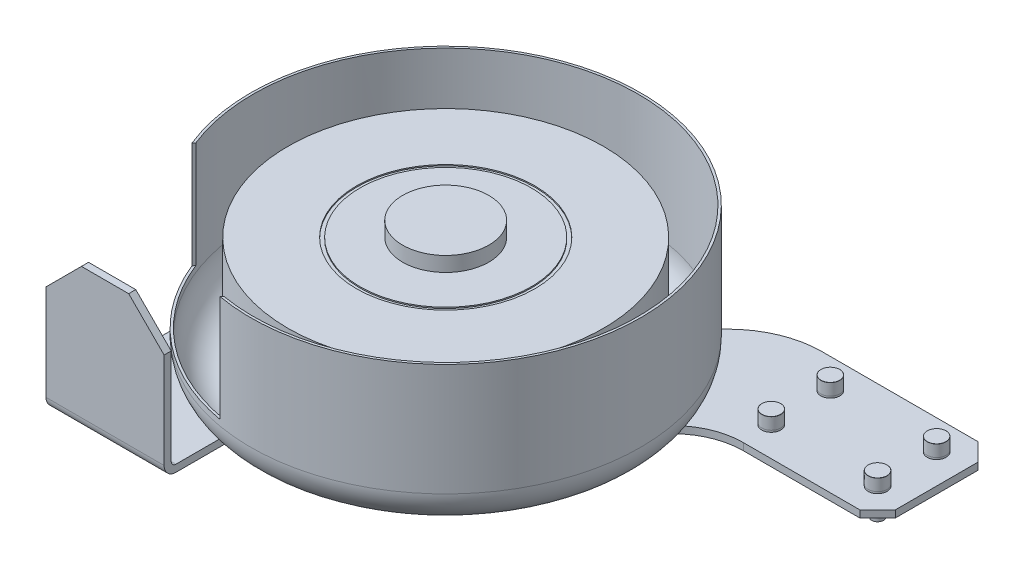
ISO-10303-21;
HEADER;
FILE_DESCRIPTION(('STEP AP214'),'2;1');
FILE_NAME('part.step','',(''),(''),'','','');
FILE_SCHEMA(('AUTOMOTIVE_DESIGN { 1 0 10303 214 1 1 1 1 }'));
ENDSEC;
DATA;
#1=APPLICATION_CONTEXT('core data for automotive mechanical design processes');
#2=APPLICATION_PROTOCOL_DEFINITION('international standard','automotive_design',2000,#1);
#3=PRODUCT_CONTEXT('',#1,'mechanical');
#4=PRODUCT('Part','Part','',(#3));
#5=PRODUCT_RELATED_PRODUCT_CATEGORY('part','',(#4));
#6=PRODUCT_DEFINITION_FORMATION('','',#4);
#7=PRODUCT_DEFINITION_CONTEXT('part definition',#1,'design');
#8=PRODUCT_DEFINITION('design','',#6,#7);
#9=PRODUCT_DEFINITION_SHAPE('','',#8);
#10=(LENGTH_UNIT() NAMED_UNIT(*) SI_UNIT(.MILLI.,.METRE.));
#11=(NAMED_UNIT(*) PLANE_ANGLE_UNIT() SI_UNIT($,.RADIAN.));
#12=(NAMED_UNIT(*) SI_UNIT($,.STERADIAN.) SOLID_ANGLE_UNIT());
#13=UNCERTAINTY_MEASURE_WITH_UNIT(LENGTH_MEASURE(1.E-05),#10,'distance_accuracy_value','');
#14=(GEOMETRIC_REPRESENTATION_CONTEXT(3) GLOBAL_UNCERTAINTY_ASSIGNED_CONTEXT((#13)) GLOBAL_UNIT_ASSIGNED_CONTEXT((#10,
#11,#12)) REPRESENTATION_CONTEXT('',''));
#15=CARTESIAN_POINT('',(0.,0.,0.));
#16=DIRECTION('',(0.,0.,1.));
#17=DIRECTION('',(1.,0.,0.));
#18=AXIS2_PLACEMENT_3D('',#15,#16,#17);
#19=CARTESIAN_POINT('',(183.514709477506,72.9690632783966,707.126118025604));
#20=DIRECTION('',(0.,1.,0.));
#21=DIRECTION('',(-1.,0.,0.));
#22=AXIS2_PLACEMENT_3D('',#19,#20,#21);
#23=PLANE('',#22);
#24=CARTESIAN_POINT('',(68.5147094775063,72.9690632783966,732.126118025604));
#25=DIRECTION('',(0.,1.,0.));
#26=DIRECTION('',(0.700989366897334,0.,0.713171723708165));
#27=AXIS2_PLACEMENT_3D('',#24,#25,#26);
#28=CIRCLE('',#27,8.);
#29=CARTESIAN_POINT('',(74.122624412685,72.9690632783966,737.831491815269));
#30=VERTEX_POINT('',#29);
#31=EDGE_CURVE('E784',#30,#30,#28,.T.);
#32=ORIENTED_EDGE('',*,*,#31,.F.);
#33=EDGE_LOOP('',(#32));
#34=FACE_BOUND('',#33,.T.);
#35=CARTESIAN_POINT('',(158.514709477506,72.9690632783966,782.126118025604));
#36=DIRECTION('',(0.,1.,0.));
#37=DIRECTION('',(0.700989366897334,0.,0.713171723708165));
#38=AXIS2_PLACEMENT_3D('',#35,#36,#37);
#39=CIRCLE('',#38,8.);
#40=CARTESIAN_POINT('',(164.122624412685,72.9690632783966,787.831491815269));
#41=VERTEX_POINT('',#40);
#42=EDGE_CURVE('E469',#41,#41,#39,.T.);
#43=ORIENTED_EDGE('',*,*,#42,.F.);
#44=EDGE_LOOP('',(#43));
#45=FACE_BOUND('',#44,.T.);
#46=CARTESIAN_POINT('',(-105.113400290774,72.9690632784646,884.126118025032));
#47=DIRECTION('',(0.,1.,0.));
#48=DIRECTION('',(0.,0.,1.));
#49=AXIS2_PLACEMENT_3D('',#46,#47,#48);
#50=CIRCLE('',#49,135.000000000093);
#51=CARTESIAN_POINT('',(19.6068194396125,72.9690632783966,832.455364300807));
#52=VERTEX_POINT('',#51);
#53=CARTESIAN_POINT('',(-50.1712288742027,72.9690632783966,760.812056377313));
#54=VERTEX_POINT('',#53);
#55=EDGE_CURVE('E34',#52,#54,#50,.T.);
#56=ORIENTED_EDGE('',*,*,#55,.F.);
#57=DIRECTION('',(-0.707106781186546,0.,0.707106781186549));
#58=VECTOR('',#57,1.);
#59=CARTESIAN_POINT('',(-154.485290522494,72.9690632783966,1006.54747426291));
#60=LINE('',#59,#58);
#61=CARTESIAN_POINT('',(27.3624725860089,72.9690632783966,824.699711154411));
#62=VERTEX_POINT('',#61);
#63=EDGE_CURVE('E398',#52,#62,#60,.F.);
#64=ORIENTED_EDGE('',*,*,#63,.T.);
#65=CARTESIAN_POINT('',(69.7888794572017,72.9690632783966,867.126118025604));
#66=DIRECTION('',(0.,1.,0.));
#67=DIRECTION('',(-1.,0.,0.));
#68=AXIS2_PLACEMENT_3D('',#65,#66,#67);
#69=CIRCLE('',#68,60.);
#70=CARTESIAN_POINT('',(69.7888794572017,72.9690632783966,807.126118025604));
#71=VERTEX_POINT('',#70);
#72=EDGE_CURVE('E380',#62,#71,#69,.F.);
#73=ORIENTED_EDGE('',*,*,#72,.T.);
#74=DIRECTION('',(-1.,0.,0.));
#75=VECTOR('',#74,1.);
#76=CARTESIAN_POINT('',(44.9360657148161,72.9690632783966,807.126118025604));
#77=LINE('',#76,#75);
#78=CARTESIAN_POINT('',(168.514709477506,72.9690632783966,807.126118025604));
#79=VERTEX_POINT('',#78);
#80=EDGE_CURVE('E375',#71,#79,#77,.F.);
#81=ORIENTED_EDGE('',*,*,#80,.T.);
#82=DIRECTION('',(-0.707106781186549,0.,0.707106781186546));
#83=VECTOR('',#82,1.);
#84=CARTESIAN_POINT('',(183.514709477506,72.9690632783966,792.126118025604));
#85=LINE('',#84,#83);
#86=CARTESIAN_POINT('',(183.514709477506,72.9690632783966,792.126118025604));
#87=VERTEX_POINT('',#86);
#88=EDGE_CURVE('E370',#79,#87,#85,.F.);
#89=ORIENTED_EDGE('',*,*,#88,.T.);
#90=DIRECTION('',(0.,0.,1.));
#91=VECTOR('',#90,1.);
#92=CARTESIAN_POINT('',(183.514709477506,72.9690632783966,707.126118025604));
#93=LINE('',#92,#91);
#94=CARTESIAN_POINT('',(183.514709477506,72.9690632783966,722.126118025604));
#95=VERTEX_POINT('',#94);
#96=EDGE_CURVE('E365',#87,#95,#93,.F.);
#97=ORIENTED_EDGE('',*,*,#96,.T.);
#98=DIRECTION('',(0.707106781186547,0.,0.707106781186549));
#99=VECTOR('',#98,1.);
#100=CARTESIAN_POINT('',(168.514709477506,72.9690632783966,707.126118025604));
#101=LINE('',#100,#99);
#102=CARTESIAN_POINT('',(168.514709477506,72.9690632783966,707.126118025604));
#103=VERTEX_POINT('',#102);
#104=EDGE_CURVE('E360',#95,#103,#101,.F.);
#105=ORIENTED_EDGE('',*,*,#104,.T.);
#106=DIRECTION('',(1.,0.,0.));
#107=VECTOR('',#106,1.);
#108=CARTESIAN_POINT('',(183.514709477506,72.9690632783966,707.126118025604));
#109=LINE('',#108,#107);
#110=CARTESIAN_POINT('',(36.6517944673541,72.9690632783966,707.126118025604));
#111=VERTEX_POINT('',#110);
#112=EDGE_CURVE('E359',#103,#111,#109,.F.);
#113=ORIENTED_EDGE('',*,*,#112,.T.);
#114=CARTESIAN_POINT('',(36.6517944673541,72.9690632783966,787.126118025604));
#115=DIRECTION('',(0.,-1.,0.));
#116=DIRECTION('',(1.,0.,0.));
#117=AXIS2_PLACEMENT_3D('',#114,#115,#116);
#118=CIRCLE('',#117,80.);
#119=CARTESIAN_POINT('',(-19.9167480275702,72.9690632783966,730.55757553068));
#120=VERTEX_POINT('',#119);
#121=EDGE_CURVE('E354',#120,#111,#118,.T.);
#122=ORIENTED_EDGE('',*,*,#121,.F.);
#123=DIRECTION('',(0.707106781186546,0.,-0.707106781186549));
#124=VECTOR('',#123,1.);
#125=CARTESIAN_POINT('',(3.51470947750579,72.9690632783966,707.126118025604));
#126=LINE('',#125,#124);
#127=EDGE_CURVE('E345',#120,#54,#126,.F.);
#128=ORIENTED_EDGE('',*,*,#127,.T.);
#129=EDGE_LOOP('',(#56,#64,#73,#81,#89,#97,#105,#113,#122,#128));
#130=FACE_BOUND('',#129,.T.);
#131=CARTESIAN_POINT('',(68.5147094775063,72.9690632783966,782.126118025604));
#132=DIRECTION('',(0.,1.,0.));
#133=DIRECTION('',(0.700989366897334,0.,0.713171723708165));
#134=AXIS2_PLACEMENT_3D('',#131,#132,#133);
#135=CIRCLE('',#134,8.);
#136=CARTESIAN_POINT('',(74.122624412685,72.9690632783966,787.831491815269));
#137=VERTEX_POINT('',#136);
#138=EDGE_CURVE('E463',#137,#137,#135,.T.);
#139=ORIENTED_EDGE('',*,*,#138,.F.);
#140=EDGE_LOOP('',(#139));
#141=FACE_BOUND('',#140,.T.);
#142=CARTESIAN_POINT('',(158.514709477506,72.9690632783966,732.126118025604));
#143=DIRECTION('',(0.,1.,0.));
#144=DIRECTION('',(-1.,0.,0.));
#145=AXIS2_PLACEMENT_3D('',#142,#143,#144);
#146=CIRCLE('',#145,8.);
#147=CARTESIAN_POINT('',(150.514709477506,72.9690632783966,732.126118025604));
#148=VERTEX_POINT('',#147);
#149=EDGE_CURVE('E27',#148,#148,#146,.T.);
#150=ORIENTED_EDGE('',*,*,#149,.F.);
#151=EDGE_LOOP('',(#150));
#152=FACE_BOUND('',#151,.T.);
#153=ADVANCED_FACE('F17',(#34,#45,#130,#141,#152),#23,.T.);
#154=CARTESIAN_POINT('',(36.6517944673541,66.9690632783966,787.126118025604));
#155=DIRECTION('',(0.,-1.,0.));
#156=DIRECTION('',(1.,0.,0.));
#157=AXIS2_PLACEMENT_3D('',#154,#155,#156);
#158=PLANE('',#157);
#159=CARTESIAN_POINT('',(158.514709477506,66.9690632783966,732.126118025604));
#160=DIRECTION('',(0.,-1.,0.));
#161=DIRECTION('',(1.,0.,0.));
#162=AXIS2_PLACEMENT_3D('',#159,#160,#161);
#163=CIRCLE('',#162,5.);
#164=CARTESIAN_POINT('',(163.514709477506,66.9690632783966,732.126118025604));
#165=VERTEX_POINT('',#164);
#166=EDGE_CURVE('E465',#165,#165,#163,.F.);
#167=ORIENTED_EDGE('',*,*,#166,.T.);
#168=EDGE_LOOP('',(#167));
#169=FACE_BOUND('',#168,.T.);
#170=CARTESIAN_POINT('',(68.5147094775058,66.9690632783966,782.126118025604));
#171=DIRECTION('',(0.,-1.,0.));
#172=DIRECTION('',(1.,0.,0.));
#173=AXIS2_PLACEMENT_3D('',#170,#171,#172);
#174=CIRCLE('',#173,5.);
#175=CARTESIAN_POINT('',(73.5147094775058,66.9690632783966,782.126118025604));
#176=VERTEX_POINT('',#175);
#177=EDGE_CURVE('E454',#176,#176,#174,.F.);
#178=ORIENTED_EDGE('',*,*,#177,.T.);
#179=EDGE_LOOP('',(#178));
#180=FACE_BOUND('',#179,.T.);
#181=DIRECTION('',(0.,0.,1.));
#182=VECTOR('',#181,1.);
#183=CARTESIAN_POINT('',(-154.485290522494,66.9690632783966,1006.54747426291));
#184=LINE('',#183,#182);
#185=CARTESIAN_POINT('',(-154.485290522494,66.9690632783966,1006.54747426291));
#186=VERTEX_POINT('',#185);
#187=CARTESIAN_POINT('',(-154.485290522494,66.9690632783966,1063.1261180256));
#188=VERTEX_POINT('',#187);
#189=EDGE_CURVE('E262',#186,#188,#184,.T.);
#190=ORIENTED_EDGE('',*,*,#189,.T.);
#191=DIRECTION('',(-1.,0.,0.));
#192=VECTOR('',#191,1.);
#193=CARTESIAN_POINT('',(36.6517944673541,66.9690632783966,1063.1261180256));
#194=LINE('',#193,#192);
#195=CARTESIAN_POINT('',(-254.485290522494,66.9690632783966,1063.1261180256));
#196=VERTEX_POINT('',#195);
#197=EDGE_CURVE('E441',#188,#196,#194,.T.);
#198=ORIENTED_EDGE('',*,*,#197,.T.);
#199=DIRECTION('',(0.,0.,-1.));
#200=VECTOR('',#199,1.);
#201=CARTESIAN_POINT('',(-254.485290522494,66.9690632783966,1073.1261180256));
#202=LINE('',#201,#200);
#203=CARTESIAN_POINT('',(-254.485290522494,66.9690632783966,965.126118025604));
#204=VERTEX_POINT('',#203);
#205=EDGE_CURVE('E266',#196,#204,#202,.T.);
#206=ORIENTED_EDGE('',*,*,#205,.T.);
#207=DIRECTION('',(0.707106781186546,0.,-0.707106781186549));
#208=VECTOR('',#207,1.);
#209=CARTESIAN_POINT('',(-254.485290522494,66.9690632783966,965.126118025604));
#210=LINE('',#209,#208);
#211=CARTESIAN_POINT('',(-19.9167480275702,66.9690632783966,730.55757553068));
#212=VERTEX_POINT('',#211);
#213=EDGE_CURVE('E269',#204,#212,#210,.T.);
#214=ORIENTED_EDGE('',*,*,#213,.T.);
#215=CARTESIAN_POINT('',(36.6517944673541,66.9690632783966,787.126118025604));
#216=DIRECTION('',(0.,-1.,0.));
#217=DIRECTION('',(1.,0.,0.));
#218=AXIS2_PLACEMENT_3D('',#215,#216,#217);
#219=CIRCLE('',#218,80.);
#220=CARTESIAN_POINT('',(36.6517944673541,66.9690632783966,707.126118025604));
#221=VERTEX_POINT('',#220);
#222=EDGE_CURVE('E273',#212,#221,#219,.T.);
#223=ORIENTED_EDGE('',*,*,#222,.T.);
#224=DIRECTION('',(1.,0.,0.));
#225=VECTOR('',#224,1.);
#226=CARTESIAN_POINT('',(36.6517944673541,66.9690632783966,707.126118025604));
#227=LINE('',#226,#225);
#228=CARTESIAN_POINT('',(168.514709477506,66.9690632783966,707.126118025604));
#229=VERTEX_POINT('',#228);
#230=EDGE_CURVE('E277',#221,#229,#227,.T.);
#231=ORIENTED_EDGE('',*,*,#230,.T.);
#232=DIRECTION('',(0.707106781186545,0.,0.70710678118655));
#233=VECTOR('',#232,1.);
#234=CARTESIAN_POINT('',(168.514709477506,66.9690632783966,707.126118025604));
#235=LINE('',#234,#233);
#236=CARTESIAN_POINT('',(183.514709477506,66.9690632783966,722.126118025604));
#237=VERTEX_POINT('',#236);
#238=EDGE_CURVE('E281',#229,#237,#235,.T.);
#239=ORIENTED_EDGE('',*,*,#238,.T.);
#240=DIRECTION('',(0.,0.,1.));
#241=VECTOR('',#240,1.);
#242=CARTESIAN_POINT('',(183.514709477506,66.9690632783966,722.126118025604));
#243=LINE('',#242,#241);
#244=CARTESIAN_POINT('',(183.514709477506,66.9690632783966,792.126118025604));
#245=VERTEX_POINT('',#244);
#246=EDGE_CURVE('E285',#237,#245,#243,.T.);
#247=ORIENTED_EDGE('',*,*,#246,.T.);
#248=DIRECTION('',(-0.707106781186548,0.,0.707106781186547));
#249=VECTOR('',#248,1.);
#250=CARTESIAN_POINT('',(183.514709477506,66.9690632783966,792.126118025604));
#251=LINE('',#250,#249);
#252=CARTESIAN_POINT('',(168.514709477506,66.9690632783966,807.126118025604));
#253=VERTEX_POINT('',#252);
#254=EDGE_CURVE('E289',#245,#253,#251,.T.);
#255=ORIENTED_EDGE('',*,*,#254,.T.);
#256=DIRECTION('',(-1.,0.,0.));
#257=VECTOR('',#256,1.);
#258=CARTESIAN_POINT('',(168.514709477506,66.9690632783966,807.126118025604));
#259=LINE('',#258,#257);
#260=CARTESIAN_POINT('',(69.7888794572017,66.9690632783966,807.126118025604));
#261=VERTEX_POINT('',#260);
#262=EDGE_CURVE('E293',#253,#261,#259,.T.);
#263=ORIENTED_EDGE('',*,*,#262,.T.);
#264=CARTESIAN_POINT('',(69.7888794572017,66.9690632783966,867.126118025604));
#265=DIRECTION('',(0.,1.,0.));
#266=DIRECTION('',(1.,0.,0.));
#267=AXIS2_PLACEMENT_3D('',#264,#265,#266);
#268=CIRCLE('',#267,60.);
#269=CARTESIAN_POINT('',(27.3624725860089,66.9690632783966,824.699711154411));
#270=VERTEX_POINT('',#269);
#271=EDGE_CURVE('E297',#261,#270,#268,.T.);
#272=ORIENTED_EDGE('',*,*,#271,.T.);
#273=DIRECTION('',(-0.707106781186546,0.,0.707106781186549));
#274=VECTOR('',#273,1.);
#275=CARTESIAN_POINT('',(27.3624725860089,66.9690632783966,824.699711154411));
#276=LINE('',#275,#274);
#277=EDGE_CURVE('E258',#270,#186,#276,.T.);
#278=ORIENTED_EDGE('',*,*,#277,.T.);
#279=EDGE_LOOP('',(#190,#198,#206,#214,#223,#231,#239,#247,#255,#263,#272,#278));
#280=FACE_BOUND('',#279,.T.);
#281=CARTESIAN_POINT('',(158.514709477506,66.9690632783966,782.126118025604));
#282=DIRECTION('',(0.,-1.,0.));
#283=DIRECTION('',(1.,0.,0.));
#284=AXIS2_PLACEMENT_3D('',#281,#282,#283);
#285=CIRCLE('',#284,5.);
#286=CARTESIAN_POINT('',(163.514709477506,66.9690632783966,782.126118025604));
#287=VERTEX_POINT('',#286);
#288=EDGE_CURVE('E459',#287,#287,#285,.F.);
#289=ORIENTED_EDGE('',*,*,#288,.T.);
#290=EDGE_LOOP('',(#289));
#291=FACE_BOUND('',#290,.T.);
#292=CARTESIAN_POINT('',(68.5147094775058,66.9690632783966,732.126118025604));
#293=DIRECTION('',(0.,-1.,0.));
#294=DIRECTION('',(1.,0.,0.));
#295=AXIS2_PLACEMENT_3D('',#292,#293,#294);
#296=CIRCLE('',#295,5.);
#297=CARTESIAN_POINT('',(73.5147094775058,66.9690632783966,732.126118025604));
#298=VERTEX_POINT('',#297);
#299=EDGE_CURVE('E471',#298,#298,#296,.F.);
#300=ORIENTED_EDGE('',*,*,#299,.T.);
#301=EDGE_LOOP('',(#300));
#302=FACE_BOUND('',#301,.T.);
#303=ADVANCED_FACE('F484',(#169,#180,#280,#291,#302),#158,.T.);
#304=CARTESIAN_POINT('',(183.514709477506,187.969063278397,707.126118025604));
#305=DIRECTION('',(0.,1.,0.));
#306=DIRECTION('',(-1.,0.,0.));
#307=AXIS2_PLACEMENT_3D('',#304,#305,#306);
#308=PLANE('',#307);
#309=DIRECTION('',(0.,0.,1.));
#310=VECTOR('',#309,1.);
#311=CARTESIAN_POINT('',(-224.485290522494,187.969063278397,707.126118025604));
#312=LINE('',#311,#310);
#313=CARTESIAN_POINT('',(-224.485290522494,187.969063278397,1073.1261180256));
#314=VERTEX_POINT('',#313);
#315=CARTESIAN_POINT('',(-224.485290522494,187.969063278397,1067.1261180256));
#316=VERTEX_POINT('',#315);
#317=EDGE_CURVE('E320',#314,#316,#312,.F.);
#318=ORIENTED_EDGE('',*,*,#317,.F.);
#319=DIRECTION('',(-1.,0.,0.));
#320=VECTOR('',#319,1.);
#321=CARTESIAN_POINT('',(-184.485290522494,187.969063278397,1073.1261180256));
#322=LINE('',#321,#320);
#323=CARTESIAN_POINT('',(-184.485290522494,187.969063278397,1073.1261180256));
#324=VERTEX_POINT('',#323);
#325=EDGE_CURVE('E301',#324,#314,#322,.T.);
#326=ORIENTED_EDGE('',*,*,#325,.F.);
#327=DIRECTION('',(0.,0.,1.));
#328=VECTOR('',#327,1.);
#329=CARTESIAN_POINT('',(-184.485290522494,187.969063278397,707.126118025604));
#330=LINE('',#329,#328);
#331=CARTESIAN_POINT('',(-184.485290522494,187.969063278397,1067.1261180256));
#332=VERTEX_POINT('',#331);
#333=EDGE_CURVE('E391',#332,#324,#330,.T.);
#334=ORIENTED_EDGE('',*,*,#333,.F.);
#335=DIRECTION('',(1.,0.,0.));
#336=VECTOR('',#335,1.);
#337=CARTESIAN_POINT('',(-154.485290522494,187.969063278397,1067.1261180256));
#338=LINE('',#337,#336);
#339=EDGE_CURVE('E390',#332,#316,#338,.F.);
#340=ORIENTED_EDGE('',*,*,#339,.T.);
#341=EDGE_LOOP('',(#318,#326,#334,#340));
#342=FACE_BOUND('',#341,.T.);
#343=ADVANCED_FACE('F492',(#342),#308,.T.);
#344=CARTESIAN_POINT('',(-224.485290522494,187.969063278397,707.126118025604));
#345=DIRECTION('',(-0.70710678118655,0.707106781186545,0.));
#346=DIRECTION('',(-0.707106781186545,-0.70710678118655,0.));
#347=AXIS2_PLACEMENT_3D('',#344,#345,#346);
#348=PLANE('',#347);
#349=DIRECTION('',(0.,0.,-1.));
#350=VECTOR('',#349,1.);
#351=CARTESIAN_POINT('',(-254.485290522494,157.969063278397,965.126118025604));
#352=LINE('',#351,#350);
#353=CARTESIAN_POINT('',(-254.485290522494,157.969063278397,1067.1261180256));
#354=VERTEX_POINT('',#353);
#355=CARTESIAN_POINT('',(-254.485290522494,157.969063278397,1073.1261180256));
#356=VERTEX_POINT('',#355);
#357=EDGE_CURVE('E337',#354,#356,#352,.F.);
#358=ORIENTED_EDGE('',*,*,#357,.T.);
#359=DIRECTION('',(-0.707106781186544,-0.707106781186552,0.));
#360=VECTOR('',#359,1.);
#361=CARTESIAN_POINT('',(-224.485290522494,187.969063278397,1073.1261180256));
#362=LINE('',#361,#360);
#363=EDGE_CURVE('E305',#314,#356,#362,.T.);
#364=ORIENTED_EDGE('',*,*,#363,.F.);
#365=ORIENTED_EDGE('',*,*,#317,.T.);
#366=DIRECTION('',(-0.707106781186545,-0.70710678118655,0.));
#367=VECTOR('',#366,1.);
#368=CARTESIAN_POINT('',(-224.485290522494,187.969063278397,1067.1261180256));
#369=LINE('',#368,#367);
#370=EDGE_CURVE('E401',#316,#354,#369,.T.);
#371=ORIENTED_EDGE('',*,*,#370,.T.);
#372=EDGE_LOOP('',(#358,#364,#365,#371));
#373=FACE_BOUND('',#372,.T.);
#374=ADVANCED_FACE('F502',(#373),#348,.T.);
#375=CARTESIAN_POINT('',(-228.427461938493,72.9690632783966,939.068289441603));
#376=VERTEX_POINT('',#375);
#377=CARTESIAN_POINT('',(-154.485290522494,72.9690632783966,1009.77410430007));
#378=VERTEX_POINT('',#377);
#379=EDGE_CURVE('E42',#376,#378,#50,.T.);
#380=ORIENTED_EDGE('',*,*,#379,.F.);
#381=CARTESIAN_POINT('',(-254.485290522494,72.9690632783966,965.126118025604));
#382=VERTEX_POINT('',#381);
#383=EDGE_CURVE('E350',#376,#382,#126,.F.);
#384=ORIENTED_EDGE('',*,*,#383,.T.);
#385=DIRECTION('',(0.,0.,-1.));
#386=VECTOR('',#385,1.);
#387=CARTESIAN_POINT('',(-254.485290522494,72.9690632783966,965.126118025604));
#388=LINE('',#387,#386);
#389=CARTESIAN_POINT('',(-254.485290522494,72.9690632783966,1063.1261180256));
#390=VERTEX_POINT('',#389);
#391=EDGE_CURVE('E338',#382,#390,#388,.F.);
#392=ORIENTED_EDGE('',*,*,#391,.T.);
#393=DIRECTION('',(1.,0.,0.));
#394=VECTOR('',#393,1.);
#395=CARTESIAN_POINT('',(183.514709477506,72.9690632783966,1063.1261180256));
#396=LINE('',#395,#394);
#397=CARTESIAN_POINT('',(-154.485290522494,72.9690632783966,1063.1261180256));
#398=VERTEX_POINT('',#397);
#399=EDGE_CURVE('E325',#390,#398,#396,.T.);
#400=ORIENTED_EDGE('',*,*,#399,.T.);
#401=DIRECTION('',(0.,0.,1.));
#402=VECTOR('',#401,1.);
#403=CARTESIAN_POINT('',(-154.485290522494,72.9690632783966,1072.1261180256));
#404=LINE('',#403,#402);
#405=EDGE_CURVE('E327',#398,#378,#404,.F.);
#406=ORIENTED_EDGE('',*,*,#405,.T.);
#407=EDGE_LOOP('',(#380,#384,#392,#400,#406));
#408=FACE_BOUND('',#407,.T.);
#409=ADVANCED_FACE('F487',(#408),#23,.T.);
#410=CARTESIAN_POINT('',(-184.485290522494,187.969063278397,707.126118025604));
#411=DIRECTION('',(0.707106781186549,0.707106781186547,0.));
#412=DIRECTION('',(-0.707106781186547,0.707106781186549,0.));
#413=AXIS2_PLACEMENT_3D('',#410,#411,#412);
#414=PLANE('',#413);
#415=DIRECTION('',(-0.707106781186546,0.707106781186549,0.));
#416=VECTOR('',#415,1.);
#417=CARTESIAN_POINT('',(-154.485290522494,157.969063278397,1067.1261180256));
#418=LINE('',#417,#416);
#419=CARTESIAN_POINT('',(-154.485290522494,157.969063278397,1067.1261180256));
#420=VERTEX_POINT('',#419);
#421=EDGE_CURVE('E386',#420,#332,#418,.T.);
#422=ORIENTED_EDGE('',*,*,#421,.T.);
#423=ORIENTED_EDGE('',*,*,#333,.T.);
#424=DIRECTION('',(-0.707106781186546,0.70710678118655,0.));
#425=VECTOR('',#424,1.);
#426=CARTESIAN_POINT('',(-154.485290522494,157.969063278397,1073.1261180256));
#427=LINE('',#426,#425);
#428=CARTESIAN_POINT('',(-154.485290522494,157.969063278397,1073.1261180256));
#429=VERTEX_POINT('',#428);
#430=EDGE_CURVE('E316',#429,#324,#427,.T.);
#431=ORIENTED_EDGE('',*,*,#430,.F.);
#432=DIRECTION('',(0.,0.,1.));
#433=VECTOR('',#432,1.);
#434=CARTESIAN_POINT('',(-154.485290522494,157.969063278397,1072.1261180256));
#435=LINE('',#434,#433);
#436=EDGE_CURVE('E326',#429,#420,#435,.F.);
#437=ORIENTED_EDGE('',*,*,#436,.T.);
#438=EDGE_LOOP('',(#422,#423,#431,#437));
#439=FACE_BOUND('',#438,.T.);
#440=ADVANCED_FACE('F501',(#439),#414,.T.);
#441=CARTESIAN_POINT('',(-154.485290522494,187.969063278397,1067.1261180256));
#442=DIRECTION('',(0.,0.,1.));
#443=DIRECTION('',(1.,0.,0.));
#444=AXIS2_PLACEMENT_3D('',#441,#442,#443);
#445=PLANE('',#444);
#446=DIRECTION('',(0.,1.,0.));
#447=VECTOR('',#446,1.);
#448=CARTESIAN_POINT('',(-154.485290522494,72.9690632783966,1067.1261180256));
#449=LINE('',#448,#447);
#450=CARTESIAN_POINT('',(-154.485290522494,76.9690632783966,1067.1261180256));
#451=VERTEX_POINT('',#450);
#452=EDGE_CURVE('E321',#420,#451,#449,.F.);
#453=ORIENTED_EDGE('',*,*,#452,.T.);
#454=DIRECTION('',(1.,0.,0.));
#455=VECTOR('',#454,1.);
#456=CARTESIAN_POINT('',(-154.485290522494,76.9690632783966,1067.1261180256));
#457=LINE('',#456,#455);
#458=CARTESIAN_POINT('',(-254.485290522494,76.9690632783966,1067.1261180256));
#459=VERTEX_POINT('',#458);
#460=EDGE_CURVE('E432',#451,#459,#457,.F.);
#461=ORIENTED_EDGE('',*,*,#460,.T.);
#462=DIRECTION('',(0.,1.,0.));
#463=VECTOR('',#462,1.);
#464=CARTESIAN_POINT('',(-254.485290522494,72.9690632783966,1067.1261180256));
#465=LINE('',#464,#463);
#466=EDGE_CURVE('E334',#459,#354,#465,.T.);
#467=ORIENTED_EDGE('',*,*,#466,.T.);
#468=ORIENTED_EDGE('',*,*,#370,.F.);
#469=ORIENTED_EDGE('',*,*,#339,.F.);
#470=ORIENTED_EDGE('',*,*,#421,.F.);
#471=EDGE_LOOP('',(#453,#461,#467,#468,#469,#470));
#472=FACE_BOUND('',#471,.T.);
#473=ADVANCED_FACE('F507',(#472),#445,.F.);
#474=CARTESIAN_POINT('',(-154.485290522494,72.9690632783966,1006.54747426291));
#475=DIRECTION('',(-0.707106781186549,0.,-0.707106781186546));
#476=DIRECTION('',(-0.707106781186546,0.,0.707106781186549));
#477=AXIS2_PLACEMENT_3D('',#474,#475,#476);
#478=PLANE('',#477);
#479=DIRECTION('',(0.,1.,0.));
#480=VECTOR('',#479,1.);
#481=CARTESIAN_POINT('',(27.3624725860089,72.9690632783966,824.699711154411));
#482=LINE('',#481,#480);
#483=EDGE_CURVE('E381',#270,#62,#482,.T.);
#484=ORIENTED_EDGE('',*,*,#483,.T.);
#485=ORIENTED_EDGE('',*,*,#63,.F.);
#486=CARTESIAN_POINT('',(-154.485290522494,72.9690632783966,1006.54747426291));
#487=VERTEX_POINT('',#486);
#488=EDGE_CURVE('E385',#487,#52,#60,.F.);
#489=ORIENTED_EDGE('',*,*,#488,.F.);
#490=DIRECTION('',(0.,1.,0.));
#491=VECTOR('',#490,1.);
#492=CARTESIAN_POINT('',(-154.485290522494,72.9690632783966,1006.54747426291));
#493=LINE('',#492,#491);
#494=EDGE_CURVE('E330',#487,#186,#493,.F.);
#495=ORIENTED_EDGE('',*,*,#494,.T.);
#496=ORIENTED_EDGE('',*,*,#277,.F.);
#497=EDGE_LOOP('',(#484,#485,#489,#495,#496));
#498=FACE_BOUND('',#497,.T.);
#499=ADVANCED_FACE('F520',(#498),#478,.F.);
#500=CARTESIAN_POINT('',(69.7888794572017,72.9690632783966,867.126118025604));
#501=DIRECTION('',(0.,1.,0.));
#502=DIRECTION('',(-1.,0.,0.));
#503=AXIS2_PLACEMENT_3D('',#500,#501,#502);
#504=CYLINDRICAL_SURFACE('',#503,60.);
#505=ORIENTED_EDGE('',*,*,#483,.F.);
#506=ORIENTED_EDGE('',*,*,#271,.F.);
#507=DIRECTION('',(0.,1.,0.));
#508=VECTOR('',#507,1.);
#509=CARTESIAN_POINT('',(69.7888794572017,72.9690632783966,807.126118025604));
#510=LINE('',#509,#508);
#511=EDGE_CURVE('E376',#261,#71,#510,.T.);
#512=ORIENTED_EDGE('',*,*,#511,.T.);
#513=ORIENTED_EDGE('',*,*,#72,.F.);
#514=EDGE_LOOP('',(#505,#506,#512,#513));
#515=FACE_BOUND('',#514,.T.);
#516=ADVANCED_FACE('F524',(#515),#504,.F.);
#517=CARTESIAN_POINT('',(44.9360657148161,72.9690632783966,807.126118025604));
#518=DIRECTION('',(0.,0.,-1.));
#519=DIRECTION('',(-1.,0.,0.));
#520=AXIS2_PLACEMENT_3D('',#517,#518,#519);
#521=PLANE('',#520);
#522=ORIENTED_EDGE('',*,*,#511,.F.);
#523=ORIENTED_EDGE('',*,*,#262,.F.);
#524=DIRECTION('',(0.,1.,0.));
#525=VECTOR('',#524,1.);
#526=CARTESIAN_POINT('',(168.514709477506,72.9690632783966,807.126118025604));
#527=LINE('',#526,#525);
#528=EDGE_CURVE('E371',#253,#79,#527,.T.);
#529=ORIENTED_EDGE('',*,*,#528,.T.);
#530=ORIENTED_EDGE('',*,*,#80,.F.);
#531=EDGE_LOOP('',(#522,#523,#529,#530));
#532=FACE_BOUND('',#531,.T.);
#533=ADVANCED_FACE('F528',(#532),#521,.F.);
#534=CARTESIAN_POINT('',(183.514709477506,72.9690632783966,792.126118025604));
#535=DIRECTION('',(-0.707106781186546,0.,-0.707106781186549));
#536=DIRECTION('',(-0.707106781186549,0.,0.707106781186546));
#537=AXIS2_PLACEMENT_3D('',#534,#535,#536);
#538=PLANE('',#537);
#539=ORIENTED_EDGE('',*,*,#528,.F.);
#540=ORIENTED_EDGE('',*,*,#254,.F.);
#541=DIRECTION('',(0.,1.,0.));
#542=VECTOR('',#541,1.);
#543=CARTESIAN_POINT('',(183.514709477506,72.9690632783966,792.126118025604));
#544=LINE('',#543,#542);
#545=EDGE_CURVE('E366',#245,#87,#544,.T.);
#546=ORIENTED_EDGE('',*,*,#545,.T.);
#547=ORIENTED_EDGE('',*,*,#88,.F.);
#548=EDGE_LOOP('',(#539,#540,#546,#547));
#549=FACE_BOUND('',#548,.T.);
#550=ADVANCED_FACE('F532',(#549),#538,.F.);
#551=CARTESIAN_POINT('',(183.514709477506,72.9690632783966,707.126118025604));
#552=DIRECTION('',(-1.,0.,0.));
#553=DIRECTION('',(0.,0.,1.));
#554=AXIS2_PLACEMENT_3D('',#551,#552,#553);
#555=PLANE('',#554);
#556=DIRECTION('',(0.,1.,0.));
#557=VECTOR('',#556,1.);
#558=CARTESIAN_POINT('',(183.514709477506,72.9690632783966,722.126118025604));
#559=LINE('',#558,#557);
#560=EDGE_CURVE('E361',#237,#95,#559,.T.);
#561=ORIENTED_EDGE('',*,*,#560,.T.);
#562=ORIENTED_EDGE('',*,*,#96,.F.);
#563=ORIENTED_EDGE('',*,*,#545,.F.);
#564=ORIENTED_EDGE('',*,*,#246,.F.);
#565=EDGE_LOOP('',(#561,#562,#563,#564));
#566=FACE_BOUND('',#565,.T.);
#567=ADVANCED_FACE('F536',(#566),#555,.F.);
#568=CARTESIAN_POINT('',(168.514709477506,72.9690632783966,707.126118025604));
#569=DIRECTION('',(-0.707106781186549,0.,0.707106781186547));
#570=DIRECTION('',(0.707106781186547,0.,0.707106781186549));
#571=AXIS2_PLACEMENT_3D('',#568,#569,#570);
#572=PLANE('',#571);
#573=ORIENTED_EDGE('',*,*,#560,.F.);
#574=ORIENTED_EDGE('',*,*,#238,.F.);
#575=DIRECTION('',(0.,1.,0.));
#576=VECTOR('',#575,1.);
#577=CARTESIAN_POINT('',(168.514709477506,72.9690632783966,707.126118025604));
#578=LINE('',#577,#576);
#579=EDGE_CURVE('E355',#229,#103,#578,.T.);
#580=ORIENTED_EDGE('',*,*,#579,.T.);
#581=ORIENTED_EDGE('',*,*,#104,.F.);
#582=EDGE_LOOP('',(#573,#574,#580,#581));
#583=FACE_BOUND('',#582,.T.);
#584=ADVANCED_FACE('F540',(#583),#572,.F.);
#585=CARTESIAN_POINT('',(183.514709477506,72.9690632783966,707.126118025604));
#586=DIRECTION('',(0.,0.,1.));
#587=DIRECTION('',(1.,0.,0.));
#588=AXIS2_PLACEMENT_3D('',#585,#586,#587);
#589=PLANE('',#588);
#590=DIRECTION('',(0.,-1.,0.));
#591=VECTOR('',#590,1.);
#592=CARTESIAN_POINT('',(36.6517944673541,72.9690632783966,707.126118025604));
#593=LINE('',#592,#591);
#594=EDGE_CURVE('E351',#111,#221,#593,.T.);
#595=ORIENTED_EDGE('',*,*,#594,.F.);
#596=ORIENTED_EDGE('',*,*,#112,.F.);
#597=ORIENTED_EDGE('',*,*,#579,.F.);
#598=ORIENTED_EDGE('',*,*,#230,.F.);
#599=EDGE_LOOP('',(#595,#596,#597,#598));
#600=FACE_BOUND('',#599,.T.);
#601=ADVANCED_FACE('F544',(#600),#589,.F.);
#602=CARTESIAN_POINT('',(36.6517944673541,72.9690632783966,787.126118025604));
#603=DIRECTION('',(0.,-1.,0.));
#604=DIRECTION('',(1.,0.,0.));
#605=AXIS2_PLACEMENT_3D('',#602,#603,#604);
#606=CYLINDRICAL_SURFACE('',#605,80.);
#607=ORIENTED_EDGE('',*,*,#594,.T.);
#608=ORIENTED_EDGE('',*,*,#222,.F.);
#609=DIRECTION('',(0.,1.,0.));
#610=VECTOR('',#609,1.);
#611=CARTESIAN_POINT('',(-19.9167480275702,72.9690632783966,730.55757553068));
#612=LINE('',#611,#610);
#613=EDGE_CURVE('E346',#212,#120,#612,.T.);
#614=ORIENTED_EDGE('',*,*,#613,.T.);
#615=ORIENTED_EDGE('',*,*,#121,.T.);
#616=EDGE_LOOP('',(#607,#608,#614,#615));
#617=FACE_BOUND('',#616,.T.);
#618=ADVANCED_FACE('F548',(#617),#606,.T.);
#619=CARTESIAN_POINT('',(3.51470947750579,72.9690632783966,707.126118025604));
#620=DIRECTION('',(0.707106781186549,0.,0.707106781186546));
#621=DIRECTION('',(0.707106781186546,0.,-0.707106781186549));
#622=AXIS2_PLACEMENT_3D('',#619,#620,#621);
#623=PLANE('',#622);
#624=ORIENTED_EDGE('',*,*,#613,.F.);
#625=ORIENTED_EDGE('',*,*,#213,.F.);
#626=DIRECTION('',(0.,1.,0.));
#627=VECTOR('',#626,1.);
#628=CARTESIAN_POINT('',(-254.485290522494,72.9690632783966,965.126118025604));
#629=LINE('',#628,#627);
#630=EDGE_CURVE('E342',#204,#382,#629,.T.);
#631=ORIENTED_EDGE('',*,*,#630,.T.);
#632=ORIENTED_EDGE('',*,*,#383,.F.);
#633=DIRECTION('',(-0.707106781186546,0.,0.707106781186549));
#634=VECTOR('',#633,1.);
#635=CARTESIAN_POINT('',(3.51470947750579,72.9690632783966,707.126118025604));
#636=LINE('',#635,#634);
#637=EDGE_CURVE('E236',#54,#376,#636,.T.);
#638=ORIENTED_EDGE('',*,*,#637,.F.);
#639=ORIENTED_EDGE('',*,*,#127,.F.);
#640=EDGE_LOOP('',(#624,#625,#631,#632,#638,#639));
#641=FACE_BOUND('',#640,.T.);
#642=ADVANCED_FACE('F552',(#641),#623,.F.);
#643=CARTESIAN_POINT('',(-254.485290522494,72.9690632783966,965.126118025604));
#644=DIRECTION('',(1.,0.,0.));
#645=DIRECTION('',(0.,0.,-1.));
#646=AXIS2_PLACEMENT_3D('',#643,#644,#645);
#647=PLANE('',#646);
#648=ORIENTED_EDGE('',*,*,#205,.F.);
#649=CARTESIAN_POINT('',(-254.485290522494,76.9690632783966,1063.1261180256));
#650=DIRECTION('',(1.,0.,0.));
#651=DIRECTION('',(0.,0.,-1.));
#652=AXIS2_PLACEMENT_3D('',#649,#650,#651);
#653=CIRCLE('',#652,10.);
#654=CARTESIAN_POINT('',(-254.485290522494,76.9690632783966,1073.1261180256));
#655=VERTEX_POINT('',#654);
#656=EDGE_CURVE('E445',#196,#655,#653,.F.);
#657=ORIENTED_EDGE('',*,*,#656,.T.);
#658=DIRECTION('',(0.,-1.,0.));
#659=VECTOR('',#658,1.);
#660=CARTESIAN_POINT('',(-254.485290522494,157.969063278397,1073.1261180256));
#661=LINE('',#660,#659);
#662=EDGE_CURVE('E309',#356,#655,#661,.T.);
#663=ORIENTED_EDGE('',*,*,#662,.F.);
#664=ORIENTED_EDGE('',*,*,#357,.F.);
#665=ORIENTED_EDGE('',*,*,#466,.F.);
#666=CARTESIAN_POINT('',(-254.485290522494,76.9690632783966,1063.1261180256));
#667=DIRECTION('',(1.,0.,0.));
#668=DIRECTION('',(0.,0.,-1.));
#669=AXIS2_PLACEMENT_3D('',#666,#667,#668);
#670=CIRCLE('',#669,4.);
#671=EDGE_CURVE('E438',#459,#390,#670,.T.);
#672=ORIENTED_EDGE('',*,*,#671,.T.);
#673=ORIENTED_EDGE('',*,*,#391,.F.);
#674=ORIENTED_EDGE('',*,*,#630,.F.);
#675=EDGE_LOOP('',(#648,#657,#663,#664,#665,#672,#673,#674));
#676=FACE_BOUND('',#675,.T.);
#677=ADVANCED_FACE('F556',(#676),#647,.F.);
#678=CARTESIAN_POINT('',(-154.485290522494,72.9690632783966,1072.1261180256));
#679=DIRECTION('',(-1.,0.,0.));
#680=DIRECTION('',(0.,0.,1.));
#681=AXIS2_PLACEMENT_3D('',#678,#679,#680);
#682=PLANE('',#681);
#683=DIRECTION('',(0.,1.,0.));
#684=VECTOR('',#683,1.);
#685=CARTESIAN_POINT('',(-154.485290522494,67.9690632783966,1073.1261180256));
#686=LINE('',#685,#684);
#687=CARTESIAN_POINT('',(-154.485290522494,76.9690632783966,1073.1261180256));
#688=VERTEX_POINT('',#687);
#689=EDGE_CURVE('E313',#688,#429,#686,.T.);
#690=ORIENTED_EDGE('',*,*,#689,.F.);
#691=CARTESIAN_POINT('',(-154.485290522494,76.9690632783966,1063.1261180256));
#692=DIRECTION('',(-1.,0.,0.));
#693=DIRECTION('',(0.,0.,1.));
#694=AXIS2_PLACEMENT_3D('',#691,#692,#693);
#695=CIRCLE('',#694,10.);
#696=EDGE_CURVE('E451',#688,#188,#695,.F.);
#697=ORIENTED_EDGE('',*,*,#696,.T.);
#698=ORIENTED_EDGE('',*,*,#189,.F.);
#699=ORIENTED_EDGE('',*,*,#494,.F.);
#700=EDGE_CURVE('E331',#378,#487,#404,.F.);
#701=ORIENTED_EDGE('',*,*,#700,.F.);
#702=ORIENTED_EDGE('',*,*,#405,.F.);
#703=CARTESIAN_POINT('',(-154.485290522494,76.9690632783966,1063.1261180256));
#704=DIRECTION('',(-1.,0.,0.));
#705=DIRECTION('',(0.,0.,1.));
#706=AXIS2_PLACEMENT_3D('',#703,#704,#705);
#707=CIRCLE('',#706,4.);
#708=EDGE_CURVE('E435',#398,#451,#707,.T.);
#709=ORIENTED_EDGE('',*,*,#708,.T.);
#710=ORIENTED_EDGE('',*,*,#452,.F.);
#711=ORIENTED_EDGE('',*,*,#436,.F.);
#712=EDGE_LOOP('',(#690,#697,#698,#699,#701,#702,#709,#710,#711));
#713=FACE_BOUND('',#712,.T.);
#714=ADVANCED_FACE('F495',(#713),#682,.F.);
#715=CARTESIAN_POINT('',(117.514709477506,-117.030936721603,1073.1261180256));
#716=DIRECTION('',(0.,0.,1.));
#717=DIRECTION('',(1.,0.,0.));
#718=AXIS2_PLACEMENT_3D('',#715,#716,#717);
#719=PLANE('',#718);
#720=ORIENTED_EDGE('',*,*,#662,.T.);
#721=DIRECTION('',(-1.,0.,0.));
#722=VECTOR('',#721,1.);
#723=CARTESIAN_POINT('',(117.514709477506,76.9690632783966,1073.1261180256));
#724=LINE('',#723,#722);
#725=EDGE_CURVE('E448',#655,#688,#724,.F.);
#726=ORIENTED_EDGE('',*,*,#725,.T.);
#727=ORIENTED_EDGE('',*,*,#689,.T.);
#728=ORIENTED_EDGE('',*,*,#430,.T.);
#729=ORIENTED_EDGE('',*,*,#325,.T.);
#730=ORIENTED_EDGE('',*,*,#363,.T.);
#731=EDGE_LOOP('',(#720,#726,#727,#728,#729,#730));
#732=FACE_BOUND('',#731,.T.);
#733=ADVANCED_FACE('F516',(#732),#719,.T.);
#734=CARTESIAN_POINT('',(183.514709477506,76.9690632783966,1063.1261180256));
#735=DIRECTION('',(1.,0.,0.));
#736=DIRECTION('',(0.,0.,-1.));
#737=AXIS2_PLACEMENT_3D('',#734,#735,#736);
#738=CYLINDRICAL_SURFACE('',#737,4.);
#739=ORIENTED_EDGE('',*,*,#671,.F.);
#740=ORIENTED_EDGE('',*,*,#460,.F.);
#741=ORIENTED_EDGE('',*,*,#708,.F.);
#742=ORIENTED_EDGE('',*,*,#399,.F.);
#743=EDGE_LOOP('',(#739,#740,#741,#742));
#744=FACE_BOUND('',#743,.T.);
#745=ADVANCED_FACE('F565',(#744),#738,.F.);
#746=CARTESIAN_POINT('',(36.6517944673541,76.9690632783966,1063.1261180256));
#747=DIRECTION('',(-1.,0.,0.));
#748=DIRECTION('',(0.,-1.,0.));
#749=AXIS2_PLACEMENT_3D('',#746,#747,#748);
#750=CYLINDRICAL_SURFACE('',#749,10.);
#751=ORIENTED_EDGE('',*,*,#696,.F.);
#752=ORIENTED_EDGE('',*,*,#725,.F.);
#753=ORIENTED_EDGE('',*,*,#656,.F.);
#754=ORIENTED_EDGE('',*,*,#197,.F.);
#755=EDGE_LOOP('',(#751,#752,#753,#754));
#756=FACE_BOUND('',#755,.T.);
#757=ADVANCED_FACE('F582',(#756),#750,.T.);
#758=CARTESIAN_POINT('',(31.5066138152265,72.9690632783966,747.506103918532));
#759=DIRECTION('',(0.,1.,0.));
#760=DIRECTION('',(-1.,0.,0.));
#761=AXIS2_PLACEMENT_3D('',#758,#759,#760);
#762=PLANE('',#761);
#763=EDGE_CURVE('E253',#54,#376,#50,.T.);
#764=ORIENTED_EDGE('',*,*,#763,.F.);
#765=ORIENTED_EDGE('',*,*,#637,.T.);
#766=EDGE_LOOP('',(#764,#765));
#767=FACE_BOUND('',#766,.T.);
#768=ADVANCED_FACE('F579',(#767),#762,.F.);
#769=ORIENTED_EDGE('',*,*,#700,.T.);
#770=ORIENTED_EDGE('',*,*,#488,.T.);
#771=EDGE_CURVE('E254',#378,#52,#50,.T.);
#772=ORIENTED_EDGE('',*,*,#771,.F.);
#773=EDGE_LOOP('',(#769,#770,#772));
#774=FACE_BOUND('',#773,.T.);
#775=ADVANCED_FACE('F572',(#774),#762,.F.);
#776=CARTESIAN_POINT('',(-132.316297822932,107.969063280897,1044.84015713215));
#777=DIRECTION('',(0.777145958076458,-1.55348395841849E-10,0.629320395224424));
#778=DIRECTION('',(1.48264117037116E-10,1.,6.37601083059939E-11));
#779=AXIS2_PLACEMENT_3D('',#776,#777,#778);
#780=PLANE('',#779);
#781=DIRECTION('',(0.,-1.,0.));
#782=VECTOR('',#781,1.);
#783=CARTESIAN_POINT('',(-132.316297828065,150.469063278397,1044.84015712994));
#784=LINE('',#783,#782);
#785=CARTESIAN_POINT('',(-132.316297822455,107.969063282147,1044.84015713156));
#786=VERTEX_POINT('',#785);
#787=CARTESIAN_POINT('',(-132.316297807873,197.969063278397,1044.84015713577));
#788=VERTEX_POINT('',#787);
#789=EDGE_CURVE('E190',#786,#788,#784,.F.);
#790=ORIENTED_EDGE('',*,*,#789,.F.);
#791=DIRECTION('',(-0.629320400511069,0.,0.777145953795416));
#792=VECTOR('',#791,1.);
#793=CARTESIAN_POINT('',(-132.316297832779,107.969063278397,1044.84015715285));
#794=LINE('',#793,#792);
#795=CARTESIAN_POINT('',(-133.758128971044,107.969063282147,1046.6206702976));
#796=VERTEX_POINT('',#795);
#797=EDGE_CURVE('E224',#796,#786,#794,.F.);
#798=ORIENTED_EDGE('',*,*,#797,.F.);
#799=DIRECTION('',(0.,-1.,0.));
#800=VECTOR('',#799,1.);
#801=CARTESIAN_POINT('',(-133.75812896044,150.469063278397,1046.62067030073));
#802=LINE('',#801,#800);
#803=CARTESIAN_POINT('',(-133.758129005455,197.969063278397,1046.62067028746));
#804=VERTEX_POINT('',#803);
#805=EDGE_CURVE('E225',#796,#804,#802,.F.);
#806=ORIENTED_EDGE('',*,*,#805,.T.);
#807=DIRECTION('',(0.629320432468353,0.,-0.777145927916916));
#808=VECTOR('',#807,1.);
#809=CARTESIAN_POINT('',(-133.758128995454,197.969063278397,1046.62067020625));
#810=LINE('',#809,#808);
#811=EDGE_CURVE('E240',#788,#804,#810,.F.);
#812=ORIENTED_EDGE('',*,*,#811,.F.);
#813=EDGE_LOOP('',(#790,#798,#806,#812));
#814=FACE_BOUND('',#813,.T.);
#815=ADVANCED_FACE('F568',(#814),#780,.F.);
#816=CARTESIAN_POINT('',(-105.113400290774,102.969063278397,884.126118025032));
#817=DIRECTION('',(0.,1.,0.));
#818=DIRECTION('',(0.,0.,1.));
#819=AXIS2_PLACEMENT_3D('',#816,#817,#818);
#820=TOROIDAL_SURFACE('',#819,135.000000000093,29.9999999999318);
#821=CARTESIAN_POINT('',(-105.113400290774,102.969063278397,884.126118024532));
#822=DIRECTION('',(0.,1.,0.));
#823=DIRECTION('',(-1.,0.,0.));
#824=AXIS2_PLACEMENT_3D('',#821,#822,#823);
#825=CIRCLE('',#824,165.);
#826=CARTESIAN_POINT('',(-270.113400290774,102.969063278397,884.126118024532));
#827=VERTEX_POINT('',#826);
#828=EDGE_CURVE('E229',#827,#827,#825,.F.);
#829=ORIENTED_EDGE('',*,*,#828,.T.);
#830=EDGE_LOOP('',(#829));
#831=FACE_BOUND('',#830,.T.);
#832=ORIENTED_EDGE('',*,*,#55,.T.);
#833=ORIENTED_EDGE('',*,*,#763,.T.);
#834=ORIENTED_EDGE('',*,*,#379,.T.);
#835=ORIENTED_EDGE('',*,*,#771,.T.);
#836=EDGE_LOOP('',(#832,#833,#834,#835));
#837=FACE_BOUND('',#836,.T.);
#838=ADVANCED_FACE('F571',(#831,#837),#820,.T.);
#839=CARTESIAN_POINT('',(-105.113400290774,102.969063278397,884.126118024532));
#840=DIRECTION('',(0.,1.,0.));
#841=DIRECTION('',(0.,0.,1.));
#842=AXIS2_PLACEMENT_3D('',#839,#840,#841);
#843=CYLINDRICAL_SURFACE('',#842,165.);
#844=ORIENTED_EDGE('',*,*,#828,.F.);
#845=EDGE_LOOP('',(#844));
#846=FACE_BOUND('',#845,.T.);
#847=ORIENTED_EDGE('',*,*,#805,.F.);
#848=CARTESIAN_POINT('',(-105.113400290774,107.969063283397,884.126118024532));
#849=DIRECTION('',(0.,1.,0.));
#850=DIRECTION('',(0.,0.,1.));
#851=AXIS2_PLACEMENT_3D('',#848,#849,#850);
#852=CIRCLE('',#851,165.);
#853=CARTESIAN_POINT('',(-258.101482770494,107.969063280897,945.929407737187));
#854=VERTEX_POINT('',#853);
#855=EDGE_CURVE('E243',#854,#796,#852,.T.);
#856=ORIENTED_EDGE('',*,*,#855,.F.);
#857=DIRECTION('',(0.,1.,0.));
#858=VECTOR('',#857,1.);
#859=CARTESIAN_POINT('',(-258.101482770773,152.969063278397,945.929407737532));
#860=LINE('',#859,#858);
#861=CARTESIAN_POINT('',(-258.101482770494,197.969063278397,945.929407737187));
#862=VERTEX_POINT('',#861);
#863=EDGE_CURVE('E221',#854,#862,#860,.T.);
#864=ORIENTED_EDGE('',*,*,#863,.T.);
#865=CARTESIAN_POINT('',(-105.113400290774,197.969063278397,884.126118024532));
#866=DIRECTION('',(0.,1.,0.));
#867=DIRECTION('',(0.,0.,1.));
#868=AXIS2_PLACEMENT_3D('',#865,#866,#867);
#869=CIRCLE('',#868,165.);
#870=EDGE_CURVE('E200',#804,#862,#869,.T.);
#871=ORIENTED_EDGE('',*,*,#870,.F.);
#872=EDGE_LOOP('',(#847,#856,#864,#871));
#873=FACE_BOUND('',#872,.T.);
#874=ADVANCED_FACE('F577',(#846,#873),#843,.T.);
#875=CARTESIAN_POINT('',(-256.659651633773,107.969063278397,944.148894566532));
#876=DIRECTION('',(-0.777145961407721,0.,-0.629320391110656));
#877=DIRECTION('',(-0.629320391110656,0.,0.777145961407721));
#878=AXIS2_PLACEMENT_3D('',#875,#876,#877);
#879=PLANE('',#878);
#880=DIRECTION('',(-0.629320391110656,0.,0.777145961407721));
#881=VECTOR('',#880,1.);
#882=CARTESIAN_POINT('',(-256.659651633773,197.969063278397,944.148894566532));
#883=LINE('',#882,#881);
#884=CARTESIAN_POINT('',(-256.659651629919,197.969063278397,944.148894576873));
#885=VERTEX_POINT('',#884);
#886=EDGE_CURVE('E197',#862,#885,#883,.F.);
#887=ORIENTED_EDGE('',*,*,#886,.F.);
#888=ORIENTED_EDGE('',*,*,#863,.F.);
#889=DIRECTION('',(-0.629320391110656,0.,0.777145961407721));
#890=VECTOR('',#889,1.);
#891=CARTESIAN_POINT('',(-256.659651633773,107.969063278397,944.148894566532));
#892=LINE('',#891,#890);
#893=CARTESIAN_POINT('',(-256.659651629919,107.969063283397,944.148894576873));
#894=VERTEX_POINT('',#893);
#895=EDGE_CURVE('E207',#894,#854,#892,.T.);
#896=ORIENTED_EDGE('',*,*,#895,.F.);
#897=DIRECTION('',(0.,1.,0.));
#898=VECTOR('',#897,1.);
#899=CARTESIAN_POINT('',(-256.659651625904,150.469063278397,944.148894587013));
#900=LINE('',#899,#898);
#901=EDGE_CURVE('E187',#885,#894,#900,.F.);
#902=ORIENTED_EDGE('',*,*,#901,.F.);
#903=EDGE_LOOP('',(#887,#888,#896,#902));
#904=FACE_BOUND('',#903,.T.);
#905=ADVANCED_FACE('F205',(#904),#879,.F.);
#906=CARTESIAN_POINT('',(-131.561586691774,107.969063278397,943.534063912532));
#907=DIRECTION('',(0.,1.,0.));
#908=DIRECTION('',(-1.,0.,0.));
#909=AXIS2_PLACEMENT_3D('',#906,#907,#908);
#910=PLANE('',#909);
#911=ORIENTED_EDGE('',*,*,#895,.T.);
#912=ORIENTED_EDGE('',*,*,#855,.T.);
#913=ORIENTED_EDGE('',*,*,#797,.T.);
#914=CARTESIAN_POINT('',(-105.113400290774,107.969063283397,884.126118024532));
#915=DIRECTION('',(0.,1.,0.));
#916=DIRECTION('',(0.,0.,1.));
#917=AXIS2_PLACEMENT_3D('',#914,#915,#916);
#918=CIRCLE('',#917,163.);
#919=EDGE_CURVE('E210',#894,#786,#918,.T.);
#920=ORIENTED_EDGE('',*,*,#919,.F.);
#921=EDGE_LOOP('',(#911,#912,#913,#920));
#922=FACE_BOUND('',#921,.T.);
#923=ADVANCED_FACE('F586',(#922),#910,.T.);
#924=CARTESIAN_POINT('',(61.8665997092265,197.969063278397,717.146118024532));
#925=DIRECTION('',(0.,1.,0.));
#926=DIRECTION('',(-1.,0.,0.));
#927=AXIS2_PLACEMENT_3D('',#924,#925,#926);
#928=PLANE('',#927);
#929=ORIENTED_EDGE('',*,*,#886,.T.);
#930=CARTESIAN_POINT('',(-105.113400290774,197.969063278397,884.126118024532));
#931=DIRECTION('',(0.,1.,0.));
#932=DIRECTION('',(0.,0.,1.));
#933=AXIS2_PLACEMENT_3D('',#930,#931,#932);
#934=CIRCLE('',#933,163.);
#935=EDGE_CURVE('E181',#788,#885,#934,.T.);
#936=ORIENTED_EDGE('',*,*,#935,.F.);
#937=ORIENTED_EDGE('',*,*,#811,.T.);
#938=ORIENTED_EDGE('',*,*,#870,.T.);
#939=EDGE_LOOP('',(#929,#936,#937,#938));
#940=FACE_BOUND('',#939,.T.);
#941=ADVANCED_FACE('F198',(#940),#928,.T.);
#942=CARTESIAN_POINT('',(31.5066138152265,74.9690632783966,747.506103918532));
#943=DIRECTION('',(0.,1.,0.));
#944=DIRECTION('',(-1.,0.,0.));
#945=AXIS2_PLACEMENT_3D('',#942,#943,#944);
#946=PLANE('',#945);
#947=CARTESIAN_POINT('',(-105.113400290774,74.9690632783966,884.126118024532));
#948=DIRECTION('',(0.,1.,0.));
#949=DIRECTION('',(-1.,0.,0.));
#950=AXIS2_PLACEMENT_3D('',#947,#948,#949);
#951=CIRCLE('',#950,133.5);
#952=CARTESIAN_POINT('',(-238.613400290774,74.9690632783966,884.126118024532));
#953=VERTEX_POINT('',#952);
#954=EDGE_CURVE('E21',#953,#953,#951,.F.);
#955=ORIENTED_EDGE('',*,*,#954,.T.);
#956=EDGE_LOOP('',(#955));
#957=FACE_BOUND('',#956,.T.);
#958=CARTESIAN_POINT('',(-105.113400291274,74.9690632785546,884.126118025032));
#959=DIRECTION('',(0.,1.,0.));
#960=DIRECTION('',(0.,0.,1.));
#961=AXIS2_PLACEMENT_3D('',#958,#959,#960);
#962=CIRCLE('',#961,135.000000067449);
#963=CARTESIAN_POINT('',(-105.113400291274,74.9690632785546,1019.12611809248));
#964=VERTEX_POINT('',#963);
#965=EDGE_CURVE('E233',#964,#964,#962,.T.);
#966=ORIENTED_EDGE('',*,*,#965,.T.);
#967=EDGE_LOOP('',(#966));
#968=FACE_BOUND('',#967,.T.);
#969=ADVANCED_FACE('F592',(#957,#968),#946,.T.);
#970=CARTESIAN_POINT('',(-105.113400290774,102.969063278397,884.126118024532));
#971=DIRECTION('',(0.,1.,0.));
#972=DIRECTION('',(0.,0.,1.));
#973=AXIS2_PLACEMENT_3D('',#970,#971,#972);
#974=CYLINDRICAL_SURFACE('',#973,163.);
#975=ORIENTED_EDGE('',*,*,#901,.T.);
#976=ORIENTED_EDGE('',*,*,#919,.T.);
#977=ORIENTED_EDGE('',*,*,#789,.T.);
#978=ORIENTED_EDGE('',*,*,#935,.T.);
#979=EDGE_LOOP('',(#975,#976,#977,#978));
#980=FACE_BOUND('',#979,.T.);
#981=CARTESIAN_POINT('',(-105.113400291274,102.969063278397,884.126118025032));
#982=DIRECTION('',(0.,-1.,0.));
#983=DIRECTION('',(0.,0.,-1.));
#984=AXIS2_PLACEMENT_3D('',#981,#982,#983);
#985=CIRCLE('',#984,163.000000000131);
#986=CARTESIAN_POINT('',(-105.113400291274,102.969063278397,721.126118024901));
#987=VERTEX_POINT('',#986);
#988=EDGE_CURVE('E194',#987,#987,#985,.T.);
#989=ORIENTED_EDGE('',*,*,#988,.T.);
#990=EDGE_LOOP('',(#989));
#991=FACE_BOUND('',#990,.T.);
#992=ADVANCED_FACE('F183',(#980,#991),#974,.F.);
#993=CARTESIAN_POINT('',(-105.113400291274,102.969063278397,884.126118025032));
#994=DIRECTION('',(0.,1.,0.));
#995=DIRECTION('',(0.,0.,1.));
#996=AXIS2_PLACEMENT_3D('',#993,#994,#995);
#997=TOROIDAL_SURFACE('',#996,135.000000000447,27.9999999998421);
#998=ORIENTED_EDGE('',*,*,#965,.F.);
#999=EDGE_LOOP('',(#998));
#1000=FACE_BOUND('',#999,.T.);
#1001=ORIENTED_EDGE('',*,*,#988,.F.);
#1002=EDGE_LOOP('',(#1001));
#1003=FACE_BOUND('',#1002,.T.);
#1004=ADVANCED_FACE('F596',(#1000,#1003),#997,.F.);
#1005=CARTESIAN_POINT('',(73.5147094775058,49.4690632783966,782.126118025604));
#1006=DIRECTION('',(0.,1.,0.));
#1007=DIRECTION('',(0.,0.,1.));
#1008=AXIS2_PLACEMENT_3D('',#1005,#1006,#1007);
#1009=PLANE('',#1008);
#1010=CARTESIAN_POINT('',(68.5147094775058,49.4690632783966,782.126118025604));
#1011=DIRECTION('',(0.,1.,0.));
#1012=DIRECTION('',(0.,0.,1.));
#1013=AXIS2_PLACEMENT_3D('',#1010,#1011,#1012);
#1014=CIRCLE('',#1013,3.701);
#1015=CARTESIAN_POINT('',(68.5147094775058,49.4690632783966,785.827118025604));
#1016=VERTEX_POINT('',#1015);
#1017=EDGE_CURVE('E840',#1016,#1016,#1014,.T.);
#1018=ORIENTED_EDGE('',*,*,#1017,.F.);
#1019=EDGE_LOOP('',(#1018));
#1020=FACE_BOUND('',#1019,.T.);
#1021=ADVANCED_FACE('F574',(#1020),#1009,.F.);
#1022=CARTESIAN_POINT('',(68.5147094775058,50.2190412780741,782.126118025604));
#1023=DIRECTION('',(0.,1.,0.));
#1024=DIRECTION('',(0.,0.,1.));
#1025=AXIS2_PLACEMENT_3D('',#1022,#1023,#1024);
#1026=CONICAL_SURFACE('',#1025,5.,1.0471975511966);
#1027=ORIENTED_EDGE('',*,*,#1017,.T.);
#1028=EDGE_LOOP('',(#1027));
#1029=FACE_BOUND('',#1028,.T.);
#1030=CARTESIAN_POINT('',(68.5147094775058,50.2190412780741,782.126118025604));
#1031=DIRECTION('',(0.,1.,0.));
#1032=DIRECTION('',(0.,0.,1.));
#1033=AXIS2_PLACEMENT_3D('',#1030,#1031,#1032);
#1034=CIRCLE('',#1033,5.);
#1035=CARTESIAN_POINT('',(68.5147094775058,50.2190412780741,787.126118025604));
#1036=VERTEX_POINT('',#1035);
#1037=EDGE_CURVE('E847',#1036,#1036,#1034,.T.);
#1038=ORIENTED_EDGE('',*,*,#1037,.F.);
#1039=EDGE_LOOP('',(#1038));
#1040=FACE_BOUND('',#1039,.T.);
#1041=ADVANCED_FACE('F622',(#1029,#1040),#1026,.T.);
#1042=CARTESIAN_POINT('',(68.5147094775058,84.4690632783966,782.126118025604));
#1043=DIRECTION('',(0.,1.,0.));
#1044=DIRECTION('',(0.,0.,1.));
#1045=AXIS2_PLACEMENT_3D('',#1042,#1043,#1044);
#1046=CYLINDRICAL_SURFACE('',#1045,5.);
#1047=ORIENTED_EDGE('',*,*,#177,.F.);
#1048=EDGE_LOOP('',(#1047));
#1049=FACE_BOUND('',#1048,.T.);
#1050=ORIENTED_EDGE('',*,*,#1037,.T.);
#1051=EDGE_LOOP('',(#1050));
#1052=FACE_BOUND('',#1051,.T.);
#1053=ADVANCED_FACE('F619',(#1049,#1052),#1046,.T.);
#1054=CARTESIAN_POINT('',(68.5147094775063,74.4690632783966,782.126118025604));
#1055=DIRECTION('',(0.,-1.,0.));
#1056=DIRECTION('',(-0.700989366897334,0.,-0.713171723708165));
#1057=AXIS2_PLACEMENT_3D('',#1054,#1055,#1056);
#1058=CYLINDRICAL_SURFACE('',#1057,8.);
#1059=CARTESIAN_POINT('',(68.5147094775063,74.4690632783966,782.126118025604));
#1060=DIRECTION('',(0.,1.,0.));
#1061=DIRECTION('',(0.700989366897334,0.,0.713171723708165));
#1062=AXIS2_PLACEMENT_3D('',#1059,#1060,#1061);
#1063=CIRCLE('',#1062,8.);
#1064=CARTESIAN_POINT('',(74.122624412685,74.4690632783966,787.831491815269));
#1065=VERTEX_POINT('',#1064);
#1066=EDGE_CURVE('E836',#1065,#1065,#1063,.T.);
#1067=ORIENTED_EDGE('',*,*,#1066,.F.);
#1068=EDGE_LOOP('',(#1067));
#1069=FACE_BOUND('',#1068,.T.);
#1070=ORIENTED_EDGE('',*,*,#138,.T.);
#1071=EDGE_LOOP('',(#1070));
#1072=FACE_BOUND('',#1071,.T.);
#1073=ADVANCED_FACE('F613',(#1069,#1072),#1058,.T.);
#1074=CARTESIAN_POINT('',(68.5147094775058,84.4690632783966,782.126118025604));
#1075=DIRECTION('',(0.,-1.,0.));
#1076=DIRECTION('',(0.,0.,-1.));
#1077=AXIS2_PLACEMENT_3D('',#1074,#1075,#1076);
#1078=PLANE('',#1077);
#1079=CARTESIAN_POINT('',(68.5147094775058,84.4690632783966,782.126118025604));
#1080=DIRECTION('',(0.,-1.,0.));
#1081=DIRECTION('',(0.,0.,-1.));
#1082=AXIS2_PLACEMENT_3D('',#1079,#1080,#1081);
#1083=CIRCLE('',#1082,7.9);
#1084=CARTESIAN_POINT('',(68.5147094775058,84.4690632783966,774.226118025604));
#1085=VERTEX_POINT('',#1084);
#1086=EDGE_CURVE('E851',#1085,#1085,#1083,.F.);
#1087=ORIENTED_EDGE('',*,*,#1086,.T.);
#1088=EDGE_LOOP('',(#1087));
#1089=FACE_BOUND('',#1088,.T.);
#1090=ADVANCED_FACE('F609',(#1089),#1078,.F.);
#1091=CARTESIAN_POINT('',(68.5147094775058,84.3690632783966,782.126118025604));
#1092=DIRECTION('',(0.,-1.,0.));
#1093=DIRECTION('',(0.,0.,-1.));
#1094=AXIS2_PLACEMENT_3D('',#1091,#1092,#1093);
#1095=TOROIDAL_SURFACE('',#1094,7.9,0.1);
#1096=CARTESIAN_POINT('',(68.5147094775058,84.3690632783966,782.126118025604));
#1097=DIRECTION('',(0.,-1.,0.));
#1098=DIRECTION('',(0.,0.,-1.));
#1099=AXIS2_PLACEMENT_3D('',#1096,#1097,#1098);
#1100=CIRCLE('',#1099,8.);
#1101=CARTESIAN_POINT('',(68.5147094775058,84.3690632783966,774.126118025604));
#1102=VERTEX_POINT('',#1101);
#1103=EDGE_CURVE('E458',#1102,#1102,#1100,.T.);
#1104=ORIENTED_EDGE('',*,*,#1103,.F.);
#1105=EDGE_LOOP('',(#1104));
#1106=FACE_BOUND('',#1105,.T.);
#1107=ORIENTED_EDGE('',*,*,#1086,.F.);
#1108=EDGE_LOOP('',(#1107));
#1109=FACE_BOUND('',#1108,.T.);
#1110=ADVANCED_FACE('F605',(#1106,#1109),#1095,.T.);
#1111=CARTESIAN_POINT('',(68.5147094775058,84.4690632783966,782.126118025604));
#1112=DIRECTION('',(0.,1.,0.));
#1113=DIRECTION('',(0.,0.,1.));
#1114=AXIS2_PLACEMENT_3D('',#1111,#1112,#1113);
#1115=CYLINDRICAL_SURFACE('',#1114,8.);
#1116=ORIENTED_EDGE('',*,*,#1103,.T.);
#1117=EDGE_LOOP('',(#1116));
#1118=FACE_BOUND('',#1117,.T.);
#1119=ORIENTED_EDGE('',*,*,#1066,.T.);
#1120=EDGE_LOOP('',(#1119));
#1121=FACE_BOUND('',#1120,.T.);
#1122=ADVANCED_FACE('F608',(#1118,#1121),#1115,.T.);
#1123=CARTESIAN_POINT('',(163.514709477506,49.4690632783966,782.126118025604));
#1124=DIRECTION('',(0.,1.,0.));
#1125=DIRECTION('',(0.,0.,1.));
#1126=AXIS2_PLACEMENT_3D('',#1123,#1124,#1125);
#1127=PLANE('',#1126);
#1128=CARTESIAN_POINT('',(158.514709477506,49.4690632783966,782.126118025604));
#1129=DIRECTION('',(0.,1.,0.));
#1130=DIRECTION('',(0.,0.,1.));
#1131=AXIS2_PLACEMENT_3D('',#1128,#1129,#1130);
#1132=CIRCLE('',#1131,3.701);
#1133=CARTESIAN_POINT('',(158.514709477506,49.4690632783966,785.827118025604));
#1134=VERTEX_POINT('',#1133);
#1135=EDGE_CURVE('E819',#1134,#1134,#1132,.T.);
#1136=ORIENTED_EDGE('',*,*,#1135,.F.);
#1137=EDGE_LOOP('',(#1136));
#1138=FACE_BOUND('',#1137,.T.);
#1139=ADVANCED_FACE('F617',(#1138),#1127,.F.);
#1140=CARTESIAN_POINT('',(158.514709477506,50.2190412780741,782.126118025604));
#1141=DIRECTION('',(0.,1.,0.));
#1142=DIRECTION('',(0.,0.,1.));
#1143=AXIS2_PLACEMENT_3D('',#1140,#1141,#1142);
#1144=CONICAL_SURFACE('',#1143,5.,1.0471975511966);
#1145=ORIENTED_EDGE('',*,*,#1135,.T.);
#1146=EDGE_LOOP('',(#1145));
#1147=FACE_BOUND('',#1146,.T.);
#1148=CARTESIAN_POINT('',(158.514709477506,50.2190412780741,782.126118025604));
#1149=DIRECTION('',(0.,1.,0.));
#1150=DIRECTION('',(0.,0.,1.));
#1151=AXIS2_PLACEMENT_3D('',#1148,#1149,#1150);
#1152=CIRCLE('',#1151,5.);
#1153=CARTESIAN_POINT('',(158.514709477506,50.2190412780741,787.126118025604));
#1154=VERTEX_POINT('',#1153);
#1155=EDGE_CURVE('E826',#1154,#1154,#1152,.T.);
#1156=ORIENTED_EDGE('',*,*,#1155,.F.);
#1157=EDGE_LOOP('',(#1156));
#1158=FACE_BOUND('',#1157,.T.);
#1159=ADVANCED_FACE('F650',(#1147,#1158),#1144,.T.);
#1160=CARTESIAN_POINT('',(158.514709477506,84.4690632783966,782.126118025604));
#1161=DIRECTION('',(0.,1.,0.));
#1162=DIRECTION('',(0.,0.,1.));
#1163=AXIS2_PLACEMENT_3D('',#1160,#1161,#1162);
#1164=CYLINDRICAL_SURFACE('',#1163,5.);
#1165=ORIENTED_EDGE('',*,*,#288,.F.);
#1166=EDGE_LOOP('',(#1165));
#1167=FACE_BOUND('',#1166,.T.);
#1168=ORIENTED_EDGE('',*,*,#1155,.T.);
#1169=EDGE_LOOP('',(#1168));
#1170=FACE_BOUND('',#1169,.T.);
#1171=ADVANCED_FACE('F647',(#1167,#1170),#1164,.T.);
#1172=CARTESIAN_POINT('',(158.514709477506,74.4690632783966,782.126118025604));
#1173=DIRECTION('',(0.,-1.,0.));
#1174=DIRECTION('',(-0.700989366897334,0.,-0.713171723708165));
#1175=AXIS2_PLACEMENT_3D('',#1172,#1173,#1174);
#1176=CYLINDRICAL_SURFACE('',#1175,8.);
#1177=CARTESIAN_POINT('',(158.514709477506,74.4690632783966,782.126118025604));
#1178=DIRECTION('',(0.,1.,0.));
#1179=DIRECTION('',(0.700989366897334,0.,0.713171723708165));
#1180=AXIS2_PLACEMENT_3D('',#1177,#1178,#1179);
#1181=CIRCLE('',#1180,8.);
#1182=CARTESIAN_POINT('',(164.122624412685,74.4690632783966,787.831491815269));
#1183=VERTEX_POINT('',#1182);
#1184=EDGE_CURVE('E816',#1183,#1183,#1181,.T.);
#1185=ORIENTED_EDGE('',*,*,#1184,.F.);
#1186=EDGE_LOOP('',(#1185));
#1187=FACE_BOUND('',#1186,.T.);
#1188=ORIENTED_EDGE('',*,*,#42,.T.);
#1189=EDGE_LOOP('',(#1188));
#1190=FACE_BOUND('',#1189,.T.);
#1191=ADVANCED_FACE('F641',(#1187,#1190),#1176,.T.);
#1192=CARTESIAN_POINT('',(158.514709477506,84.4690632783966,782.126118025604));
#1193=DIRECTION('',(0.,-1.,0.));
#1194=DIRECTION('',(0.,0.,-1.));
#1195=AXIS2_PLACEMENT_3D('',#1192,#1193,#1194);
#1196=PLANE('',#1195);
#1197=CARTESIAN_POINT('',(158.514709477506,84.4690632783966,782.126118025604));
#1198=DIRECTION('',(0.,-1.,0.));
#1199=DIRECTION('',(0.,0.,-1.));
#1200=AXIS2_PLACEMENT_3D('',#1197,#1198,#1199);
#1201=CIRCLE('',#1200,7.9);
#1202=CARTESIAN_POINT('',(158.514709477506,84.4690632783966,774.226118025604));
#1203=VERTEX_POINT('',#1202);
#1204=EDGE_CURVE('E829',#1203,#1203,#1201,.F.);
#1205=ORIENTED_EDGE('',*,*,#1204,.T.);
#1206=EDGE_LOOP('',(#1205));
#1207=FACE_BOUND('',#1206,.T.);
#1208=ADVANCED_FACE('F637',(#1207),#1196,.F.);
#1209=CARTESIAN_POINT('',(158.514709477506,84.3690632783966,782.126118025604));
#1210=DIRECTION('',(0.,-1.,0.));
#1211=DIRECTION('',(0.,0.,-1.));
#1212=AXIS2_PLACEMENT_3D('',#1209,#1210,#1211);
#1213=TOROIDAL_SURFACE('',#1212,7.9,0.1);
#1214=CARTESIAN_POINT('',(158.514709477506,84.3690632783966,782.126118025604));
#1215=DIRECTION('',(0.,-1.,0.));
#1216=DIRECTION('',(0.,0.,-1.));
#1217=AXIS2_PLACEMENT_3D('',#1214,#1215,#1216);
#1218=CIRCLE('',#1217,8.);
#1219=CARTESIAN_POINT('',(158.514709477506,84.3690632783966,774.126118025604));
#1220=VERTEX_POINT('',#1219);
#1221=EDGE_CURVE('E464',#1220,#1220,#1218,.T.);
#1222=ORIENTED_EDGE('',*,*,#1221,.F.);
#1223=EDGE_LOOP('',(#1222));
#1224=FACE_BOUND('',#1223,.T.);
#1225=ORIENTED_EDGE('',*,*,#1204,.F.);
#1226=EDGE_LOOP('',(#1225));
#1227=FACE_BOUND('',#1226,.T.);
#1228=ADVANCED_FACE('F633',(#1224,#1227),#1213,.T.);
#1229=CARTESIAN_POINT('',(158.514709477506,84.4690632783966,782.126118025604));
#1230=DIRECTION('',(0.,1.,0.));
#1231=DIRECTION('',(0.,0.,1.));
#1232=AXIS2_PLACEMENT_3D('',#1229,#1230,#1231);
#1233=CYLINDRICAL_SURFACE('',#1232,8.);
#1234=ORIENTED_EDGE('',*,*,#1221,.T.);
#1235=EDGE_LOOP('',(#1234));
#1236=FACE_BOUND('',#1235,.T.);
#1237=ORIENTED_EDGE('',*,*,#1184,.T.);
#1238=EDGE_LOOP('',(#1237));
#1239=FACE_BOUND('',#1238,.T.);
#1240=ADVANCED_FACE('F636',(#1236,#1239),#1233,.T.);
#1241=CARTESIAN_POINT('',(163.514709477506,49.4690632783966,732.126118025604));
#1242=DIRECTION('',(0.,1.,0.));
#1243=DIRECTION('',(0.,0.,1.));
#1244=AXIS2_PLACEMENT_3D('',#1241,#1242,#1243);
#1245=PLANE('',#1244);
#1246=CARTESIAN_POINT('',(158.514709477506,49.4690632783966,732.126118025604));
#1247=DIRECTION('',(0.,1.,0.));
#1248=DIRECTION('',(0.,0.,1.));
#1249=AXIS2_PLACEMENT_3D('',#1246,#1247,#1248);
#1250=CIRCLE('',#1249,3.701);
#1251=CARTESIAN_POINT('',(158.514709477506,49.4690632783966,735.827118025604));
#1252=VERTEX_POINT('',#1251);
#1253=EDGE_CURVE('E475',#1252,#1252,#1250,.T.);
#1254=ORIENTED_EDGE('',*,*,#1253,.F.);
#1255=EDGE_LOOP('',(#1254));
#1256=FACE_BOUND('',#1255,.T.);
#1257=ADVANCED_FACE('F645',(#1256),#1245,.F.);
#1258=CARTESIAN_POINT('',(158.514709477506,50.2190412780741,732.126118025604));
#1259=DIRECTION('',(0.,1.,0.));
#1260=DIRECTION('',(0.,0.,1.));
#1261=AXIS2_PLACEMENT_3D('',#1258,#1259,#1260);
#1262=CONICAL_SURFACE('',#1261,5.,1.0471975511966);
#1263=ORIENTED_EDGE('',*,*,#1253,.T.);
#1264=EDGE_LOOP('',(#1263));
#1265=FACE_BOUND('',#1264,.T.);
#1266=CARTESIAN_POINT('',(158.514709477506,50.2190412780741,732.126118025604));
#1267=DIRECTION('',(0.,1.,0.));
#1268=DIRECTION('',(0.,0.,1.));
#1269=AXIS2_PLACEMENT_3D('',#1266,#1267,#1268);
#1270=CIRCLE('',#1269,5.);
#1271=CARTESIAN_POINT('',(158.514709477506,50.2190412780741,737.126118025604));
#1272=VERTEX_POINT('',#1271);
#1273=EDGE_CURVE('E805',#1272,#1272,#1270,.T.);
#1274=ORIENTED_EDGE('',*,*,#1273,.F.);
#1275=EDGE_LOOP('',(#1274));
#1276=FACE_BOUND('',#1275,.T.);
#1277=ADVANCED_FACE('F678',(#1265,#1276),#1262,.T.);
#1278=CARTESIAN_POINT('',(158.514709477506,84.4690632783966,732.126118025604));
#1279=DIRECTION('',(0.,1.,0.));
#1280=DIRECTION('',(0.,0.,1.));
#1281=AXIS2_PLACEMENT_3D('',#1278,#1279,#1280);
#1282=CYLINDRICAL_SURFACE('',#1281,5.);
#1283=ORIENTED_EDGE('',*,*,#166,.F.);
#1284=EDGE_LOOP('',(#1283));
#1285=FACE_BOUND('',#1284,.T.);
#1286=ORIENTED_EDGE('',*,*,#1273,.T.);
#1287=EDGE_LOOP('',(#1286));
#1288=FACE_BOUND('',#1287,.T.);
#1289=ADVANCED_FACE('F674',(#1285,#1288),#1282,.T.);
#1290=CARTESIAN_POINT('',(73.5147094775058,49.4690632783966,732.126118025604));
#1291=DIRECTION('',(0.,1.,0.));
#1292=DIRECTION('',(0.,0.,1.));
#1293=AXIS2_PLACEMENT_3D('',#1290,#1291,#1292);
#1294=PLANE('',#1293);
#1295=CARTESIAN_POINT('',(68.5147094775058,49.4690632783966,732.126118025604));
#1296=DIRECTION('',(0.,1.,0.));
#1297=DIRECTION('',(0.,0.,1.));
#1298=AXIS2_PLACEMENT_3D('',#1295,#1296,#1297);
#1299=CIRCLE('',#1298,3.701);
#1300=CARTESIAN_POINT('',(68.5147094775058,49.4690632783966,735.827118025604));
#1301=VERTEX_POINT('',#1300);
#1302=EDGE_CURVE('E783',#1301,#1301,#1299,.T.);
#1303=ORIENTED_EDGE('',*,*,#1302,.F.);
#1304=EDGE_LOOP('',(#1303));
#1305=FACE_BOUND('',#1304,.T.);
#1306=ADVANCED_FACE('F677',(#1305),#1294,.F.);
#1307=CARTESIAN_POINT('',(68.5147094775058,50.2190412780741,732.126118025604));
#1308=DIRECTION('',(0.,1.,0.));
#1309=DIRECTION('',(0.,0.,1.));
#1310=AXIS2_PLACEMENT_3D('',#1307,#1308,#1309);
#1311=CONICAL_SURFACE('',#1310,5.,1.0471975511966);
#1312=ORIENTED_EDGE('',*,*,#1302,.T.);
#1313=EDGE_LOOP('',(#1312));
#1314=FACE_BOUND('',#1313,.T.);
#1315=CARTESIAN_POINT('',(68.5147094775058,50.2190412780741,732.126118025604));
#1316=DIRECTION('',(0.,1.,0.));
#1317=DIRECTION('',(0.,0.,1.));
#1318=AXIS2_PLACEMENT_3D('',#1315,#1316,#1317);
#1319=CIRCLE('',#1318,5.);
#1320=CARTESIAN_POINT('',(68.5147094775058,50.2190412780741,737.126118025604));
#1321=VERTEX_POINT('',#1320);
#1322=EDGE_CURVE('E791',#1321,#1321,#1319,.T.);
#1323=ORIENTED_EDGE('',*,*,#1322,.F.);
#1324=EDGE_LOOP('',(#1323));
#1325=FACE_BOUND('',#1324,.T.);
#1326=ADVANCED_FACE('F702',(#1314,#1325),#1311,.T.);
#1327=CARTESIAN_POINT('',(68.5147094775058,84.4690632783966,732.126118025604));
#1328=DIRECTION('',(0.,1.,0.));
#1329=DIRECTION('',(0.,0.,1.));
#1330=AXIS2_PLACEMENT_3D('',#1327,#1328,#1329);
#1331=CYLINDRICAL_SURFACE('',#1330,5.);
#1332=ORIENTED_EDGE('',*,*,#299,.F.);
#1333=EDGE_LOOP('',(#1332));
#1334=FACE_BOUND('',#1333,.T.);
#1335=ORIENTED_EDGE('',*,*,#1322,.T.);
#1336=EDGE_LOOP('',(#1335));
#1337=FACE_BOUND('',#1336,.T.);
#1338=ADVANCED_FACE('F699',(#1334,#1337),#1331,.T.);
#1339=CARTESIAN_POINT('',(68.5147094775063,74.4690632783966,732.126118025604));
#1340=DIRECTION('',(0.,-1.,0.));
#1341=DIRECTION('',(-0.700989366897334,0.,-0.713171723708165));
#1342=AXIS2_PLACEMENT_3D('',#1339,#1340,#1341);
#1343=CYLINDRICAL_SURFACE('',#1342,8.);
#1344=CARTESIAN_POINT('',(68.5147094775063,74.4690632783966,732.126118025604));
#1345=DIRECTION('',(0.,1.,0.));
#1346=DIRECTION('',(0.700989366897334,0.,0.713171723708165));
#1347=AXIS2_PLACEMENT_3D('',#1344,#1345,#1346);
#1348=CIRCLE('',#1347,8.);
#1349=CARTESIAN_POINT('',(74.122624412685,74.4690632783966,737.831491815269));
#1350=VERTEX_POINT('',#1349);
#1351=EDGE_CURVE('E779',#1350,#1350,#1348,.T.);
#1352=ORIENTED_EDGE('',*,*,#1351,.F.);
#1353=EDGE_LOOP('',(#1352));
#1354=FACE_BOUND('',#1353,.T.);
#1355=ORIENTED_EDGE('',*,*,#31,.T.);
#1356=EDGE_LOOP('',(#1355));
#1357=FACE_BOUND('',#1356,.T.);
#1358=ADVANCED_FACE('F694',(#1354,#1357),#1343,.T.);
#1359=CARTESIAN_POINT('',(68.5147094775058,84.4690632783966,732.126118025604));
#1360=DIRECTION('',(0.,-1.,0.));
#1361=DIRECTION('',(0.,0.,-1.));
#1362=AXIS2_PLACEMENT_3D('',#1359,#1360,#1361);
#1363=PLANE('',#1362);
#1364=CARTESIAN_POINT('',(68.5147094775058,84.4690632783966,732.126118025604));
#1365=DIRECTION('',(0.,-1.,0.));
#1366=DIRECTION('',(0.,0.,-1.));
#1367=AXIS2_PLACEMENT_3D('',#1364,#1365,#1366);
#1368=CIRCLE('',#1367,7.9);
#1369=CARTESIAN_POINT('',(68.5147094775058,84.4690632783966,724.226118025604));
#1370=VERTEX_POINT('',#1369);
#1371=EDGE_CURVE('E795',#1370,#1370,#1368,.F.);
#1372=ORIENTED_EDGE('',*,*,#1371,.T.);
#1373=EDGE_LOOP('',(#1372));
#1374=FACE_BOUND('',#1373,.T.);
#1375=ADVANCED_FACE('F690',(#1374),#1363,.F.);
#1376=CARTESIAN_POINT('',(68.5147094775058,84.3690632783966,732.126118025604));
#1377=DIRECTION('',(0.,-1.,0.));
#1378=DIRECTION('',(0.,0.,-1.));
#1379=AXIS2_PLACEMENT_3D('',#1376,#1377,#1378);
#1380=TOROIDAL_SURFACE('',#1379,7.9,0.1);
#1381=CARTESIAN_POINT('',(68.5147094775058,84.3690632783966,732.126118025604));
#1382=DIRECTION('',(0.,-1.,0.));
#1383=DIRECTION('',(0.,0.,-1.));
#1384=AXIS2_PLACEMENT_3D('',#1381,#1382,#1383);
#1385=CIRCLE('',#1384,8.);
#1386=CARTESIAN_POINT('',(68.5147094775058,84.3690632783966,724.126118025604));
#1387=VERTEX_POINT('',#1386);
#1388=EDGE_CURVE('E476',#1387,#1387,#1385,.T.);
#1389=ORIENTED_EDGE('',*,*,#1388,.F.);
#1390=EDGE_LOOP('',(#1389));
#1391=FACE_BOUND('',#1390,.T.);
#1392=ORIENTED_EDGE('',*,*,#1371,.F.);
#1393=EDGE_LOOP('',(#1392));
#1394=FACE_BOUND('',#1393,.T.);
#1395=ADVANCED_FACE('F686',(#1391,#1394),#1380,.T.);
#1396=CARTESIAN_POINT('',(68.5147094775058,84.4690632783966,732.126118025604));
#1397=DIRECTION('',(0.,1.,0.));
#1398=DIRECTION('',(0.,0.,1.));
#1399=AXIS2_PLACEMENT_3D('',#1396,#1397,#1398);
#1400=CYLINDRICAL_SURFACE('',#1399,8.);
#1401=ORIENTED_EDGE('',*,*,#1388,.T.);
#1402=EDGE_LOOP('',(#1401));
#1403=FACE_BOUND('',#1402,.T.);
#1404=ORIENTED_EDGE('',*,*,#1351,.T.);
#1405=EDGE_LOOP('',(#1404));
#1406=FACE_BOUND('',#1405,.T.);
#1407=ADVANCED_FACE('F689',(#1403,#1406),#1400,.T.);
#1408=CARTESIAN_POINT('',(158.514709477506,74.4690632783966,732.126118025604));
#1409=DIRECTION('',(0.,-1.,0.));
#1410=DIRECTION('',(-0.700989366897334,0.,-0.713171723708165));
#1411=AXIS2_PLACEMENT_3D('',#1408,#1409,#1410);
#1412=CYLINDRICAL_SURFACE('',#1411,8.);
#1413=CARTESIAN_POINT('',(158.514709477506,74.4690632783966,732.126118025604));
#1414=DIRECTION('',(0.,1.,0.));
#1415=DIRECTION('',(0.700989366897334,0.,0.713171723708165));
#1416=AXIS2_PLACEMENT_3D('',#1413,#1414,#1415);
#1417=CIRCLE('',#1416,8.);
#1418=CARTESIAN_POINT('',(164.122624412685,74.4690632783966,737.831491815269));
#1419=VERTEX_POINT('',#1418);
#1420=EDGE_CURVE('E11',#1419,#1419,#1417,.T.);
#1421=ORIENTED_EDGE('',*,*,#1420,.F.);
#1422=EDGE_LOOP('',(#1421));
#1423=FACE_BOUND('',#1422,.T.);
#1424=ORIENTED_EDGE('',*,*,#149,.T.);
#1425=EDGE_LOOP('',(#1424));
#1426=FACE_BOUND('',#1425,.T.);
#1427=ADVANCED_FACE('F19',(#1423,#1426),#1412,.T.);
#1428=CARTESIAN_POINT('',(158.514709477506,84.4690632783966,732.126118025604));
#1429=DIRECTION('',(0.,-1.,0.));
#1430=DIRECTION('',(0.,0.,-1.));
#1431=AXIS2_PLACEMENT_3D('',#1428,#1429,#1430);
#1432=PLANE('',#1431);
#1433=CARTESIAN_POINT('',(158.514709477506,84.4690632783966,732.126118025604));
#1434=DIRECTION('',(0.,-1.,0.));
#1435=DIRECTION('',(0.,0.,-1.));
#1436=AXIS2_PLACEMENT_3D('',#1433,#1434,#1435);
#1437=CIRCLE('',#1436,7.9);
#1438=CARTESIAN_POINT('',(158.514709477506,84.4690632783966,724.226118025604));
#1439=VERTEX_POINT('',#1438);
#1440=EDGE_CURVE('E809',#1439,#1439,#1437,.F.);
#1441=ORIENTED_EDGE('',*,*,#1440,.T.);
#1442=EDGE_LOOP('',(#1441));
#1443=FACE_BOUND('',#1442,.T.);
#1444=ADVANCED_FACE('F665',(#1443),#1432,.F.);
#1445=CARTESIAN_POINT('',(158.514709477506,84.3690632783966,732.126118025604));
#1446=DIRECTION('',(0.,-1.,0.));
#1447=DIRECTION('',(0.,0.,-1.));
#1448=AXIS2_PLACEMENT_3D('',#1445,#1446,#1447);
#1449=TOROIDAL_SURFACE('',#1448,7.9,0.1);
#1450=CARTESIAN_POINT('',(158.514709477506,84.3690632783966,732.126118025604));
#1451=DIRECTION('',(0.,-1.,0.));
#1452=DIRECTION('',(0.,0.,-1.));
#1453=AXIS2_PLACEMENT_3D('',#1450,#1451,#1452);
#1454=CIRCLE('',#1453,8.);
#1455=CARTESIAN_POINT('',(158.514709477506,84.3690632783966,724.126118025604));
#1456=VERTEX_POINT('',#1455);
#1457=EDGE_CURVE('E470',#1456,#1456,#1454,.T.);
#1458=ORIENTED_EDGE('',*,*,#1457,.F.);
#1459=EDGE_LOOP('',(#1458));
#1460=FACE_BOUND('',#1459,.T.);
#1461=ORIENTED_EDGE('',*,*,#1440,.F.);
#1462=EDGE_LOOP('',(#1461));
#1463=FACE_BOUND('',#1462,.T.);
#1464=ADVANCED_FACE('F661',(#1460,#1463),#1449,.T.);
#1465=CARTESIAN_POINT('',(158.514709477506,84.4690632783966,732.126118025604));
#1466=DIRECTION('',(0.,1.,0.));
#1467=DIRECTION('',(0.,0.,1.));
#1468=AXIS2_PLACEMENT_3D('',#1465,#1466,#1467);
#1469=CYLINDRICAL_SURFACE('',#1468,8.);
#1470=ORIENTED_EDGE('',*,*,#1457,.T.);
#1471=EDGE_LOOP('',(#1470));
#1472=FACE_BOUND('',#1471,.T.);
#1473=ORIENTED_EDGE('',*,*,#1420,.T.);
#1474=EDGE_LOOP('',(#1473));
#1475=FACE_BOUND('',#1474,.T.);
#1476=ADVANCED_FACE('F664',(#1472,#1475),#1469,.T.);
#1477=CARTESIAN_POINT('',(-31.7434002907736,174.469063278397,810.756118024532));
#1478=DIRECTION('',(0.,1.,0.));
#1479=DIRECTION('',(-1.,0.,0.));
#1480=AXIS2_PLACEMENT_3D('',#1477,#1478,#1479);
#1481=PLANE('',#1480);
#1482=CARTESIAN_POINT('',(-105.113400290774,174.469063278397,884.126118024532));
#1483=DIRECTION('',(0.,1.,0.));
#1484=DIRECTION('',(0.,0.,1.));
#1485=AXIS2_PLACEMENT_3D('',#1482,#1483,#1484);
#1486=CIRCLE('',#1485,72.5);
#1487=CARTESIAN_POINT('',(-105.113400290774,174.469063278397,956.626118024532));
#1488=VERTEX_POINT('',#1487);
#1489=EDGE_CURVE('E764',#1488,#1488,#1486,.T.);
#1490=ORIENTED_EDGE('',*,*,#1489,.T.);
#1491=EDGE_LOOP('',(#1490));
#1492=FACE_BOUND('',#1491,.T.);
#1493=CARTESIAN_POINT('',(-105.113400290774,174.469063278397,884.126118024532));
#1494=DIRECTION('',(0.,1.,0.));
#1495=DIRECTION('',(0.,0.,1.));
#1496=AXIS2_PLACEMENT_3D('',#1493,#1494,#1495);
#1497=CIRCLE('',#1496,36.5);
#1498=CARTESIAN_POINT('',(-105.113400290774,174.469063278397,920.626118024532));
#1499=VERTEX_POINT('',#1498);
#1500=EDGE_CURVE('E748',#1499,#1499,#1497,.F.);
#1501=ORIENTED_EDGE('',*,*,#1500,.T.);
#1502=EDGE_LOOP('',(#1501));
#1503=FACE_BOUND('',#1502,.T.);
#1504=ADVANCED_FACE('F672',(#1492,#1503),#1481,.T.);
#1505=CARTESIAN_POINT('',(-105.113400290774,174.469063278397,884.126118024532));
#1506=DIRECTION('',(0.,-1.,0.));
#1507=DIRECTION('',(0.,0.,-1.));
#1508=AXIS2_PLACEMENT_3D('',#1505,#1506,#1507);
#1509=CYLINDRICAL_SURFACE('',#1508,133.5);
#1510=ORIENTED_EDGE('',*,*,#954,.F.);
#1511=EDGE_LOOP('',(#1510));
#1512=FACE_BOUND('',#1511,.T.);
#1513=CARTESIAN_POINT('',(-105.113400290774,174.469063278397,884.126118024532));
#1514=DIRECTION('',(0.,-1.,0.));
#1515=DIRECTION('',(0.,0.,-1.));
#1516=AXIS2_PLACEMENT_3D('',#1513,#1514,#1515);
#1517=CIRCLE('',#1516,133.5);
#1518=CARTESIAN_POINT('',(-105.113400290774,174.469063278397,750.626118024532));
#1519=VERTEX_POINT('',#1518);
#1520=EDGE_CURVE('E757',#1519,#1519,#1517,.F.);
#1521=ORIENTED_EDGE('',*,*,#1520,.F.);
#1522=EDGE_LOOP('',(#1521));
#1523=FACE_BOUND('',#1522,.T.);
#1524=ADVANCED_FACE('F717',(#1512,#1523),#1509,.T.);
#1525=CARTESIAN_POINT('',(29.9885997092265,174.469063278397,749.024118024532));
#1526=DIRECTION('',(0.,1.,0.));
#1527=DIRECTION('',(-1.,0.,0.));
#1528=AXIS2_PLACEMENT_3D('',#1525,#1526,#1527);
#1529=PLANE('',#1528);
#1530=CARTESIAN_POINT('',(-105.113400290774,174.469063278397,884.126118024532));
#1531=DIRECTION('',(0.,1.,0.));
#1532=DIRECTION('',(0.,0.,1.));
#1533=AXIS2_PLACEMENT_3D('',#1530,#1531,#1532);
#1534=CIRCLE('',#1533,75.505742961);
#1535=CARTESIAN_POINT('',(-105.113400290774,174.469063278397,959.631860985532));
#1536=VERTEX_POINT('',#1535);
#1537=EDGE_CURVE('E772',#1536,#1536,#1534,.T.);
#1538=ORIENTED_EDGE('',*,*,#1537,.F.);
#1539=EDGE_LOOP('',(#1538));
#1540=FACE_BOUND('',#1539,.T.);
#1541=ORIENTED_EDGE('',*,*,#1520,.T.);
#1542=EDGE_LOOP('',(#1541));
#1543=FACE_BOUND('',#1542,.T.);
#1544=ADVANCED_FACE('F713',(#1540,#1543),#1529,.T.);
#1545=CARTESIAN_POINT('',(-105.113400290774,173.469063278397,884.126118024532));
#1546=DIRECTION('',(0.,1.,0.));
#1547=DIRECTION('',(0.,0.,1.));
#1548=AXIS2_PLACEMENT_3D('',#1545,#1546,#1547);
#1549=CYLINDRICAL_SURFACE('',#1548,75.505742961);
#1550=ORIENTED_EDGE('',*,*,#1537,.T.);
#1551=EDGE_LOOP('',(#1550));
#1552=FACE_BOUND('',#1551,.T.);
#1553=CARTESIAN_POINT('',(-105.113400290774,173.469063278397,884.126118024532));
#1554=DIRECTION('',(0.,1.,0.));
#1555=DIRECTION('',(0.,0.,1.));
#1556=AXIS2_PLACEMENT_3D('',#1553,#1554,#1555);
#1557=CIRCLE('',#1556,75.505742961);
#1558=CARTESIAN_POINT('',(-105.113400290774,173.469063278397,959.631860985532));
#1559=VERTEX_POINT('',#1558);
#1560=EDGE_CURVE('E768',#1559,#1559,#1557,.T.);
#1561=ORIENTED_EDGE('',*,*,#1560,.F.);
#1562=EDGE_LOOP('',(#1561));
#1563=FACE_BOUND('',#1562,.T.);
#1564=ADVANCED_FACE('F716',(#1552,#1563),#1549,.F.);
#1565=CARTESIAN_POINT('',(-28.7015884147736,173.469063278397,807.714306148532));
#1566=DIRECTION('',(0.,1.,0.));
#1567=DIRECTION('',(-1.,0.,0.));
#1568=AXIS2_PLACEMENT_3D('',#1565,#1566,#1567);
#1569=PLANE('',#1568);
#1570=CARTESIAN_POINT('',(-105.113400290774,173.469063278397,884.126118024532));
#1571=DIRECTION('',(0.,1.,0.));
#1572=DIRECTION('',(0.,0.,1.));
#1573=AXIS2_PLACEMENT_3D('',#1570,#1571,#1572);
#1574=CIRCLE('',#1573,72.5);
#1575=CARTESIAN_POINT('',(-105.113400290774,173.469063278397,956.626118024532));
#1576=VERTEX_POINT('',#1575);
#1577=EDGE_CURVE('E760',#1576,#1576,#1574,.F.);
#1578=ORIENTED_EDGE('',*,*,#1577,.T.);
#1579=EDGE_LOOP('',(#1578));
#1580=FACE_BOUND('',#1579,.T.);
#1581=ORIENTED_EDGE('',*,*,#1560,.T.);
#1582=EDGE_LOOP('',(#1581));
#1583=FACE_BOUND('',#1582,.T.);
#1584=ADVANCED_FACE('F723',(#1580,#1583),#1569,.T.);
#1585=CARTESIAN_POINT('',(-105.113400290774,173.469063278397,884.126118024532));
#1586=DIRECTION('',(0.,1.,0.));
#1587=DIRECTION('',(0.,0.,1.));
#1588=AXIS2_PLACEMENT_3D('',#1585,#1586,#1587);
#1589=CYLINDRICAL_SURFACE('',#1588,72.5);
#1590=ORIENTED_EDGE('',*,*,#1577,.F.);
#1591=EDGE_LOOP('',(#1590));
#1592=FACE_BOUND('',#1591,.T.);
#1593=ORIENTED_EDGE('',*,*,#1489,.F.);
#1594=EDGE_LOOP('',(#1593));
#1595=FACE_BOUND('',#1594,.T.);
#1596=ADVANCED_FACE('F722',(#1592,#1595),#1589,.T.);
#1597=CARTESIAN_POINT('',(-68.1754002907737,186.969063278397,847.188118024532));
#1598=DIRECTION('',(0.,1.,0.));
#1599=DIRECTION('',(-1.,0.,0.));
#1600=AXIS2_PLACEMENT_3D('',#1597,#1598,#1599);
#1601=PLANE('',#1600);
#1602=CARTESIAN_POINT('',(-105.113400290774,186.969063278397,884.126118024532));
#1603=DIRECTION('',(0.,-1.,0.));
#1604=DIRECTION('',(0.,0.,-1.));
#1605=AXIS2_PLACEMENT_3D('',#1602,#1603,#1604);
#1606=CIRCLE('',#1605,36.5);
#1607=CARTESIAN_POINT('',(-105.113400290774,186.969063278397,847.626118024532));
#1608=VERTEX_POINT('',#1607);
#1609=EDGE_CURVE('E751',#1608,#1608,#1606,.F.);
#1610=ORIENTED_EDGE('',*,*,#1609,.T.);
#1611=EDGE_LOOP('',(#1610));
#1612=FACE_BOUND('',#1611,.T.);
#1613=ADVANCED_FACE('F736',(#1612),#1601,.T.);
#1614=CARTESIAN_POINT('',(-105.113400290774,186.969063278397,884.126118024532));
#1615=DIRECTION('',(0.,-1.,0.));
#1616=DIRECTION('',(0.,0.,-1.));
#1617=AXIS2_PLACEMENT_3D('',#1614,#1615,#1616);
#1618=CYLINDRICAL_SURFACE('',#1617,36.5);
#1619=ORIENTED_EDGE('',*,*,#1500,.F.);
#1620=EDGE_LOOP('',(#1619));
#1621=FACE_BOUND('',#1620,.T.);
#1622=ORIENTED_EDGE('',*,*,#1609,.F.);
#1623=EDGE_LOOP('',(#1622));
#1624=FACE_BOUND('',#1623,.T.);
#1625=ADVANCED_FACE('F730',(#1621,#1624),#1618,.T.);
#1626=CLOSED_SHELL('',(#153,#303,#343,#374,#409,#440,#473,#499,#516,#533,#550,#567,#584,#601,
#618,#642,#677,#714,#733,#745,#757,#768,#775,#815,#838,#874,#905,#923,#941,#969,#992,#1004,
#1021,#1041,#1053,#1073,#1090,#1110,#1122,#1139,#1159,#1171,#1191,#1208,#1228,#1240,#1257,#1277,
#1289,#1306,#1326,#1338,#1358,#1375,#1395,#1407,#1427,#1444,#1464,#1476,#1504,#1524,#1544,#1564,
#1584,#1596,#1613,#1625));
#1627=MANIFOLD_SOLID_BREP('B1',#1626);
#1628=ADVANCED_BREP_SHAPE_REPRESENTATION('',(#18,#1627),#14);
#1629=SHAPE_DEFINITION_REPRESENTATION(#9,#1628);
ENDSEC;
END-ISO-10303-21;
